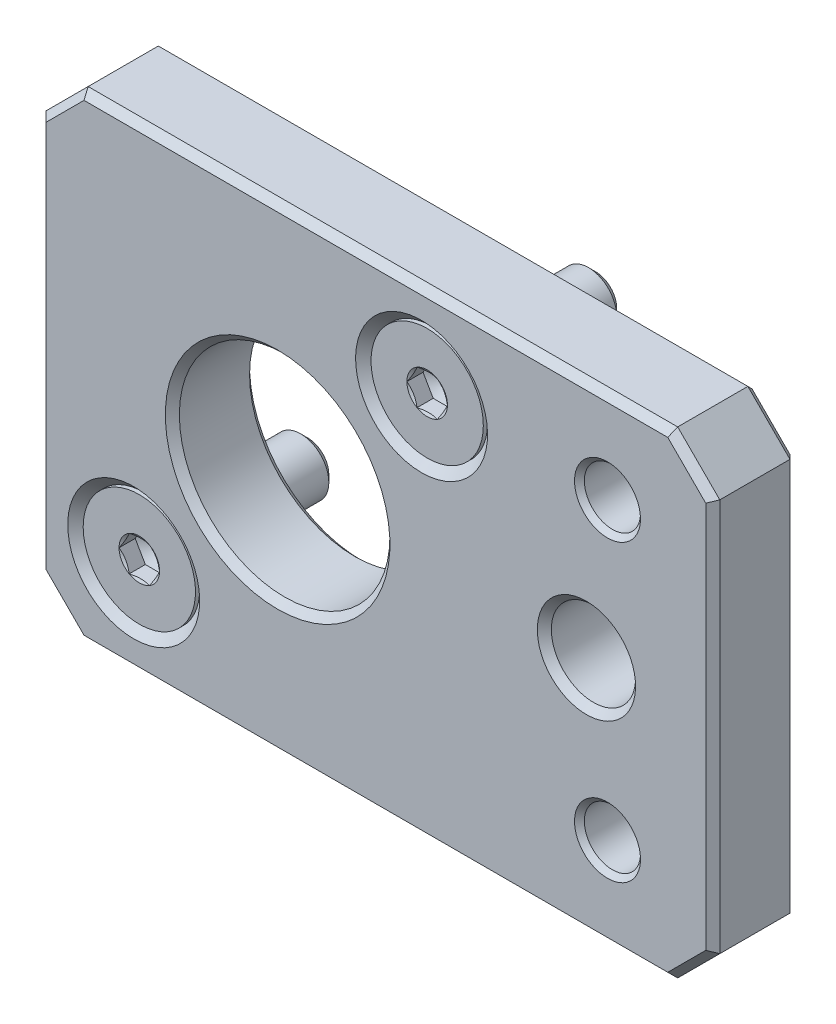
ISO-10303-21;
HEADER;
FILE_DESCRIPTION(('STEP AP214'),'2;1');
FILE_NAME('part.step','',(''),(''),'','','');
FILE_SCHEMA(('AUTOMOTIVE_DESIGN { 1 0 10303 214 1 1 1 1 }'));
ENDSEC;
DATA;
#1=APPLICATION_CONTEXT('core data for automotive mechanical design processes');
#2=APPLICATION_PROTOCOL_DEFINITION('international standard','automotive_design',2000,#1);
#3=PRODUCT_CONTEXT('',#1,'mechanical');
#4=PRODUCT('Part','Part','',(#3));
#5=PRODUCT_RELATED_PRODUCT_CATEGORY('part','',(#4));
#6=PRODUCT_DEFINITION_FORMATION('','',#4);
#7=PRODUCT_DEFINITION_CONTEXT('part definition',#1,'design');
#8=PRODUCT_DEFINITION('design','',#6,#7);
#9=PRODUCT_DEFINITION_SHAPE('','',#8);
#10=(LENGTH_UNIT() NAMED_UNIT(*) SI_UNIT(.MILLI.,.METRE.));
#11=(NAMED_UNIT(*) PLANE_ANGLE_UNIT() SI_UNIT($,.RADIAN.));
#12=(NAMED_UNIT(*) SI_UNIT($,.STERADIAN.) SOLID_ANGLE_UNIT());
#13=UNCERTAINTY_MEASURE_WITH_UNIT(LENGTH_MEASURE(1.E-05),#10,'distance_accuracy_value','');
#14=(GEOMETRIC_REPRESENTATION_CONTEXT(3) GLOBAL_UNCERTAINTY_ASSIGNED_CONTEXT((#13)) GLOBAL_UNIT_ASSIGNED_CONTEXT((#10,
#11,#12)) REPRESENTATION_CONTEXT('',''));
#15=CARTESIAN_POINT('',(0.,0.,0.));
#16=DIRECTION('',(0.,0.,1.));
#17=DIRECTION('',(1.,0.,0.));
#18=AXIS2_PLACEMENT_3D('',#15,#16,#17);
#19=CARTESIAN_POINT('',(-17.,17.,6.));
#20=DIRECTION('',(0.,-1.,0.));
#21=DIRECTION('',(0.,0.,-1.));
#22=AXIS2_PLACEMENT_3D('',#19,#20,#21);
#23=PLANE('',#22);
#24=DIRECTION('',(0.,0.,-1.));
#25=VECTOR('',#24,1.);
#26=CARTESIAN_POINT('',(28.,17.,6.));
#27=LINE('',#26,#25);
#28=CARTESIAN_POINT('',(28.,17.,5.5));
#29=VERTEX_POINT('',#28);
#30=CARTESIAN_POINT('',(28.,17.,0.5));
#31=VERTEX_POINT('',#30);
#32=EDGE_CURVE('E839',#29,#31,#27,.T.);
#33=ORIENTED_EDGE('',*,*,#32,.T.);
#34=DIRECTION('',(-1.,0.,0.));
#35=VECTOR('',#34,1.);
#36=CARTESIAN_POINT('',(-14.,17.,0.5));
#37=LINE('',#36,#35);
#38=CARTESIAN_POINT('',(-14.,17.,0.5));
#39=VERTEX_POINT('',#38);
#40=EDGE_CURVE('E904',#31,#39,#37,.T.);
#41=ORIENTED_EDGE('',*,*,#40,.T.);
#42=DIRECTION('',(0.,0.,1.));
#43=VECTOR('',#42,1.);
#44=CARTESIAN_POINT('',(-14.,17.,6.));
#45=LINE('',#44,#43);
#46=CARTESIAN_POINT('',(-14.,17.,5.5));
#47=VERTEX_POINT('',#46);
#48=EDGE_CURVE('E841',#39,#47,#45,.T.);
#49=ORIENTED_EDGE('',*,*,#48,.T.);
#50=DIRECTION('',(1.,0.,0.));
#51=VECTOR('',#50,1.);
#52=CARTESIAN_POINT('',(-17.,17.,5.5));
#53=LINE('',#52,#51);
#54=EDGE_CURVE('E902',#47,#29,#53,.T.);
#55=ORIENTED_EDGE('',*,*,#54,.T.);
#56=EDGE_LOOP('',(#33,#41,#49,#55));
#57=FACE_BOUND('',#56,.T.);
#58=ADVANCED_FACE('F14',(#57),#23,.F.);
#59=CARTESIAN_POINT('',(-17.,17.,6.));
#60=DIRECTION('',(1.,0.,0.));
#61=DIRECTION('',(0.,0.,1.));
#62=AXIS2_PLACEMENT_3D('',#59,#60,#61);
#63=PLANE('',#62);
#64=DIRECTION('',(0.,0.,-1.));
#65=VECTOR('',#64,1.);
#66=CARTESIAN_POINT('',(-17.,14.,6.));
#67=LINE('',#66,#65);
#68=CARTESIAN_POINT('',(-17.,14.,5.5));
#69=VERTEX_POINT('',#68);
#70=CARTESIAN_POINT('',(-17.,14.,0.5));
#71=VERTEX_POINT('',#70);
#72=EDGE_CURVE('E836',#69,#71,#67,.T.);
#73=ORIENTED_EDGE('',*,*,#72,.T.);
#74=DIRECTION('',(0.,-1.,0.));
#75=VECTOR('',#74,1.);
#76=CARTESIAN_POINT('',(-17.,-14.,0.5));
#77=LINE('',#76,#75);
#78=CARTESIAN_POINT('',(-17.,-14.,0.5));
#79=VERTEX_POINT('',#78);
#80=EDGE_CURVE('E895',#71,#79,#77,.T.);
#81=ORIENTED_EDGE('',*,*,#80,.T.);
#82=DIRECTION('',(0.,0.,1.));
#83=VECTOR('',#82,1.);
#84=CARTESIAN_POINT('',(-17.,-14.,6.));
#85=LINE('',#84,#83);
#86=CARTESIAN_POINT('',(-17.,-14.,5.5));
#87=VERTEX_POINT('',#86);
#88=EDGE_CURVE('E833',#79,#87,#85,.T.);
#89=ORIENTED_EDGE('',*,*,#88,.T.);
#90=DIRECTION('',(0.,1.,0.));
#91=VECTOR('',#90,1.);
#92=CARTESIAN_POINT('',(-17.,17.,5.5));
#93=LINE('',#92,#91);
#94=EDGE_CURVE('E893',#87,#69,#93,.T.);
#95=ORIENTED_EDGE('',*,*,#94,.T.);
#96=EDGE_LOOP('',(#73,#81,#89,#95));
#97=FACE_BOUND('',#96,.T.);
#98=ADVANCED_FACE('F224',(#97),#63,.F.);
#99=CARTESIAN_POINT('',(-17.,-17.,6.));
#100=DIRECTION('',(0.,1.,0.));
#101=DIRECTION('',(0.,0.,1.));
#102=AXIS2_PLACEMENT_3D('',#99,#100,#101);
#103=PLANE('',#102);
#104=DIRECTION('',(0.,0.,-1.));
#105=VECTOR('',#104,1.);
#106=CARTESIAN_POINT('',(-14.,-17.,6.));
#107=LINE('',#106,#105);
#108=CARTESIAN_POINT('',(-14.,-17.,5.5));
#109=VERTEX_POINT('',#108);
#110=CARTESIAN_POINT('',(-14.,-17.,0.5));
#111=VERTEX_POINT('',#110);
#112=EDGE_CURVE('E847',#109,#111,#107,.T.);
#113=ORIENTED_EDGE('',*,*,#112,.T.);
#114=DIRECTION('',(1.,0.,0.));
#115=VECTOR('',#114,1.);
#116=CARTESIAN_POINT('',(28.,-17.,0.5));
#117=LINE('',#116,#115);
#118=CARTESIAN_POINT('',(28.,-17.,0.5));
#119=VERTEX_POINT('',#118);
#120=EDGE_CURVE('E887',#111,#119,#117,.T.);
#121=ORIENTED_EDGE('',*,*,#120,.T.);
#122=DIRECTION('',(0.,0.,1.));
#123=VECTOR('',#122,1.);
#124=CARTESIAN_POINT('',(28.,-17.,6.));
#125=LINE('',#124,#123);
#126=CARTESIAN_POINT('',(28.,-17.,5.5));
#127=VERTEX_POINT('',#126);
#128=EDGE_CURVE('E844',#119,#127,#125,.T.);
#129=ORIENTED_EDGE('',*,*,#128,.T.);
#130=DIRECTION('',(-1.,0.,0.));
#131=VECTOR('',#130,1.);
#132=CARTESIAN_POINT('',(-17.,-17.,5.5));
#133=LINE('',#132,#131);
#134=EDGE_CURVE('E885',#127,#109,#133,.T.);
#135=ORIENTED_EDGE('',*,*,#134,.T.);
#136=EDGE_LOOP('',(#113,#121,#129,#135));
#137=FACE_BOUND('',#136,.T.);
#138=ADVANCED_FACE('F230',(#137),#103,.F.);
#139=CARTESIAN_POINT('',(31.,17.,6.));
#140=DIRECTION('',(-1.,0.,0.));
#141=DIRECTION('',(0.,0.,-1.));
#142=AXIS2_PLACEMENT_3D('',#139,#140,#141);
#143=PLANE('',#142);
#144=DIRECTION('',(0.,0.,-1.));
#145=VECTOR('',#144,1.);
#146=CARTESIAN_POINT('',(31.,-14.,6.));
#147=LINE('',#146,#145);
#148=CARTESIAN_POINT('',(31.,-14.,5.5));
#149=VERTEX_POINT('',#148);
#150=CARTESIAN_POINT('',(31.,-14.,0.5));
#151=VERTEX_POINT('',#150);
#152=EDGE_CURVE('E853',#149,#151,#147,.T.);
#153=ORIENTED_EDGE('',*,*,#152,.T.);
#154=DIRECTION('',(0.,1.,0.));
#155=VECTOR('',#154,1.);
#156=CARTESIAN_POINT('',(31.,14.,0.5));
#157=LINE('',#156,#155);
#158=CARTESIAN_POINT('',(31.,14.,0.5));
#159=VERTEX_POINT('',#158);
#160=EDGE_CURVE('E879',#151,#159,#157,.T.);
#161=ORIENTED_EDGE('',*,*,#160,.T.);
#162=DIRECTION('',(0.,0.,1.));
#163=VECTOR('',#162,1.);
#164=CARTESIAN_POINT('',(31.,14.,6.));
#165=LINE('',#164,#163);
#166=CARTESIAN_POINT('',(31.,14.,5.5));
#167=VERTEX_POINT('',#166);
#168=EDGE_CURVE('E850',#159,#167,#165,.T.);
#169=ORIENTED_EDGE('',*,*,#168,.T.);
#170=DIRECTION('',(0.,-1.,0.));
#171=VECTOR('',#170,1.);
#172=CARTESIAN_POINT('',(31.,17.,5.5));
#173=LINE('',#172,#171);
#174=EDGE_CURVE('E339',#167,#149,#173,.T.);
#175=ORIENTED_EDGE('',*,*,#174,.T.);
#176=EDGE_LOOP('',(#153,#161,#169,#175));
#177=FACE_BOUND('',#176,.T.);
#178=ADVANCED_FACE('F982',(#177),#143,.F.);
#179=CARTESIAN_POINT('',(31.,17.,6.));
#180=DIRECTION('',(0.,0.,-1.));
#181=DIRECTION('',(0.,1.,0.));
#182=AXIS2_PLACEMENT_3D('',#179,#180,#181);
#183=PLANE('',#182);
#184=DIRECTION('',(-1.,0.,0.));
#185=VECTOR('',#184,1.);
#186=CARTESIAN_POINT('',(31.,16.5,6.));
#187=LINE('',#186,#185);
#188=CARTESIAN_POINT('',(27.7928932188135,16.5,6.));
#189=VERTEX_POINT('',#188);
#190=CARTESIAN_POINT('',(-13.7928932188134,16.5,6.));
#191=VERTEX_POINT('',#190);
#192=EDGE_CURVE('E906',#189,#191,#187,.T.);
#193=ORIENTED_EDGE('',*,*,#192,.T.);
#194=DIRECTION('',(-0.707106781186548,-0.707106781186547,0.));
#195=VECTOR('',#194,1.);
#196=CARTESIAN_POINT('',(-16.6464466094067,13.6464466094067,6.));
#197=LINE('',#196,#195);
#198=CARTESIAN_POINT('',(-16.5,13.7928932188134,6.));
#199=VERTEX_POINT('',#198);
#200=EDGE_CURVE('E9',#191,#199,#197,.T.);
#201=ORIENTED_EDGE('',*,*,#200,.T.);
#202=DIRECTION('',(0.,-1.,0.));
#203=VECTOR('',#202,1.);
#204=CARTESIAN_POINT('',(-16.5,17.,6.));
#205=LINE('',#204,#203);
#206=CARTESIAN_POINT('',(-16.5,-13.7928932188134,6.));
#207=VERTEX_POINT('',#206);
#208=EDGE_CURVE('E23',#199,#207,#205,.T.);
#209=ORIENTED_EDGE('',*,*,#208,.T.);
#210=DIRECTION('',(0.707106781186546,-0.70710678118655,0.));
#211=VECTOR('',#210,1.);
#212=CARTESIAN_POINT('',(-13.6464466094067,-16.6464466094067,6.));
#213=LINE('',#212,#211);
#214=CARTESIAN_POINT('',(-13.7928932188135,-16.5,6.));
#215=VERTEX_POINT('',#214);
#216=EDGE_CURVE('E915',#207,#215,#213,.T.);
#217=ORIENTED_EDGE('',*,*,#216,.T.);
#218=DIRECTION('',(1.,0.,0.));
#219=VECTOR('',#218,1.);
#220=CARTESIAN_POINT('',(31.,-16.5,6.));
#221=LINE('',#220,#219);
#222=CARTESIAN_POINT('',(27.7928932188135,-16.5,6.));
#223=VERTEX_POINT('',#222);
#224=EDGE_CURVE('E913',#215,#223,#221,.T.);
#225=ORIENTED_EDGE('',*,*,#224,.T.);
#226=DIRECTION('',(0.70710678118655,0.707106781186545,0.));
#227=VECTOR('',#226,1.);
#228=CARTESIAN_POINT('',(30.6464466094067,-13.6464466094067,6.));
#229=LINE('',#228,#227);
#230=CARTESIAN_POINT('',(30.5,-13.7928932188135,6.));
#231=VERTEX_POINT('',#230);
#232=EDGE_CURVE('E911',#223,#231,#229,.T.);
#233=ORIENTED_EDGE('',*,*,#232,.T.);
#234=DIRECTION('',(0.,1.,0.));
#235=VECTOR('',#234,1.);
#236=CARTESIAN_POINT('',(30.5,17.,6.));
#237=LINE('',#236,#235);
#238=CARTESIAN_POINT('',(30.5,13.7928932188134,6.));
#239=VERTEX_POINT('',#238);
#240=EDGE_CURVE('E341',#231,#239,#237,.T.);
#241=ORIENTED_EDGE('',*,*,#240,.T.);
#242=DIRECTION('',(-0.707106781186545,0.70710678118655,0.));
#243=VECTOR('',#242,1.);
#244=CARTESIAN_POINT('',(27.6464466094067,16.6464466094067,6.));
#245=LINE('',#244,#243);
#246=EDGE_CURVE('E908',#239,#189,#245,.T.);
#247=ORIENTED_EDGE('',*,*,#246,.T.);
#248=EDGE_LOOP('',(#193,#201,#209,#217,#225,#233,#241,#247));
#249=FACE_BOUND('',#248,.T.);
#250=CARTESIAN_POINT('',(-10.253048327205,-10.2530483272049,6.));
#251=DIRECTION('',(0.,0.,1.));
#252=DIRECTION('',(0.,-1.,0.));
#253=AXIS2_PLACEMENT_3D('',#250,#251,#252);
#254=CIRCLE('',#253,4.7);
#255=CARTESIAN_POINT('',(-10.253048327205,-14.9530483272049,6.));
#256=VERTEX_POINT('',#255);
#257=EDGE_CURVE('E778',#256,#256,#254,.T.);
#258=ORIENTED_EDGE('',*,*,#257,.F.);
#259=EDGE_LOOP('',(#258));
#260=FACE_BOUND('',#259,.T.);
#261=CARTESIAN_POINT('',(0.,0.,6.));
#262=DIRECTION('',(0.,0.,-1.));
#263=DIRECTION('',(0.,1.,0.));
#264=AXIS2_PLACEMENT_3D('',#261,#262,#263);
#265=CIRCLE('',#264,8.);
#266=CARTESIAN_POINT('',(0.,8.,6.));
#267=VERTEX_POINT('',#266);
#268=EDGE_CURVE('E830',#267,#267,#265,.T.);
#269=ORIENTED_EDGE('',*,*,#268,.T.);
#270=EDGE_LOOP('',(#269));
#271=FACE_BOUND('',#270,.T.);
#272=CARTESIAN_POINT('',(22.,0.,6.));
#273=DIRECTION('',(0.,0.,-1.));
#274=DIRECTION('',(0.,1.,0.));
#275=AXIS2_PLACEMENT_3D('',#272,#273,#274);
#276=CIRCLE('',#275,3.5);
#277=CARTESIAN_POINT('',(22.,3.5,6.));
#278=VERTEX_POINT('',#277);
#279=EDGE_CURVE('E827',#278,#278,#276,.T.);
#280=ORIENTED_EDGE('',*,*,#279,.T.);
#281=EDGE_LOOP('',(#280));
#282=FACE_BOUND('',#281,.T.);
#283=CARTESIAN_POINT('',(10.2530483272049,10.253048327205,6.));
#284=DIRECTION('',(0.,0.,1.));
#285=DIRECTION('',(0.,-1.,0.));
#286=AXIS2_PLACEMENT_3D('',#283,#284,#285);
#287=CIRCLE('',#286,4.7);
#288=CARTESIAN_POINT('',(10.2530483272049,5.55304832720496,6.));
#289=VERTEX_POINT('',#288);
#290=EDGE_CURVE('E788',#289,#289,#287,.T.);
#291=ORIENTED_EDGE('',*,*,#290,.F.);
#292=EDGE_LOOP('',(#291));
#293=FACE_BOUND('',#292,.T.);
#294=CARTESIAN_POINT('',(23.5,10.5,6.));
#295=DIRECTION('',(0.,0.,1.));
#296=DIRECTION('',(0.,-1.,0.));
#297=AXIS2_PLACEMENT_3D('',#294,#295,#296);
#298=CIRCLE('',#297,2.35);
#299=CARTESIAN_POINT('',(23.5,8.15,6.));
#300=VERTEX_POINT('',#299);
#301=EDGE_CURVE('E797',#300,#300,#298,.T.);
#302=ORIENTED_EDGE('',*,*,#301,.F.);
#303=EDGE_LOOP('',(#302));
#304=FACE_BOUND('',#303,.T.);
#305=CARTESIAN_POINT('',(23.5,-10.5,6.));
#306=DIRECTION('',(0.,0.,1.));
#307=DIRECTION('',(0.,-1.,0.));
#308=AXIS2_PLACEMENT_3D('',#305,#306,#307);
#309=CIRCLE('',#308,2.35);
#310=CARTESIAN_POINT('',(23.5,-12.85,6.));
#311=VERTEX_POINT('',#310);
#312=EDGE_CURVE('E803',#311,#311,#309,.T.);
#313=ORIENTED_EDGE('',*,*,#312,.F.);
#314=EDGE_LOOP('',(#313));
#315=FACE_BOUND('',#314,.T.);
#316=ADVANCED_FACE('F951',(#249,#260,#271,#282,#293,#304,#315),#183,.F.);
#317=CARTESIAN_POINT('',(31.,17.,0.));
#318=DIRECTION('',(0.,0.,-1.));
#319=DIRECTION('',(0.,1.,0.));
#320=AXIS2_PLACEMENT_3D('',#317,#318,#319);
#321=PLANE('',#320);
#322=DIRECTION('',(1.,0.,0.));
#323=VECTOR('',#322,1.);
#324=CARTESIAN_POINT('',(28.,16.5,0.));
#325=LINE('',#324,#323);
#326=CARTESIAN_POINT('',(-13.7928932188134,16.5,0.));
#327=VERTEX_POINT('',#326);
#328=CARTESIAN_POINT('',(27.7928932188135,16.5,0.));
#329=VERTEX_POINT('',#328);
#330=EDGE_CURVE('E856',#327,#329,#325,.T.);
#331=ORIENTED_EDGE('',*,*,#330,.T.);
#332=DIRECTION('',(0.707106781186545,-0.70710678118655,0.));
#333=VECTOR('',#332,1.);
#334=CARTESIAN_POINT('',(29.1464466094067,15.1464466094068,0.));
#335=LINE('',#334,#333);
#336=CARTESIAN_POINT('',(30.5,13.7928932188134,0.));
#337=VERTEX_POINT('',#336);
#338=EDGE_CURVE('E870',#329,#337,#335,.T.);
#339=ORIENTED_EDGE('',*,*,#338,.T.);
#340=DIRECTION('',(0.,-1.,0.));
#341=VECTOR('',#340,1.);
#342=CARTESIAN_POINT('',(30.5,-14.,0.));
#343=LINE('',#342,#341);
#344=CARTESIAN_POINT('',(30.5,-13.7928932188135,0.));
#345=VERTEX_POINT('',#344);
#346=EDGE_CURVE('E868',#337,#345,#343,.T.);
#347=ORIENTED_EDGE('',*,*,#346,.T.);
#348=DIRECTION('',(-0.70710678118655,-0.707106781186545,0.));
#349=VECTOR('',#348,1.);
#350=CARTESIAN_POINT('',(46.1464466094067,1.85355339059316,0.));
#351=LINE('',#350,#349);
#352=CARTESIAN_POINT('',(27.7928932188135,-16.5,0.));
#353=VERTEX_POINT('',#352);
#354=EDGE_CURVE('E866',#345,#353,#351,.T.);
#355=ORIENTED_EDGE('',*,*,#354,.T.);
#356=DIRECTION('',(-1.,0.,0.));
#357=VECTOR('',#356,1.);
#358=CARTESIAN_POINT('',(-14.,-16.5,0.));
#359=LINE('',#358,#357);
#360=CARTESIAN_POINT('',(-13.7928932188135,-16.5,0.));
#361=VERTEX_POINT('',#360);
#362=EDGE_CURVE('E864',#353,#361,#359,.T.);
#363=ORIENTED_EDGE('',*,*,#362,.T.);
#364=DIRECTION('',(-0.707106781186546,0.70710678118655,0.));
#365=VECTOR('',#364,1.);
#366=CARTESIAN_POINT('',(-8.14644660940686,-22.1464466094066,0.));
#367=LINE('',#366,#365);
#368=CARTESIAN_POINT('',(-16.5,-13.7928932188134,0.));
#369=VERTEX_POINT('',#368);
#370=EDGE_CURVE('E862',#361,#369,#367,.T.);
#371=ORIENTED_EDGE('',*,*,#370,.T.);
#372=DIRECTION('',(0.,1.,0.));
#373=VECTOR('',#372,1.);
#374=CARTESIAN_POINT('',(-16.5,14.,0.));
#375=LINE('',#374,#373);
#376=CARTESIAN_POINT('',(-16.5,13.7928932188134,0.));
#377=VERTEX_POINT('',#376);
#378=EDGE_CURVE('E860',#369,#377,#375,.T.);
#379=ORIENTED_EDGE('',*,*,#378,.T.);
#380=DIRECTION('',(0.707106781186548,0.707106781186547,0.));
#381=VECTOR('',#380,1.);
#382=CARTESIAN_POINT('',(8.85355339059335,39.1464466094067,0.));
#383=LINE('',#382,#381);
#384=EDGE_CURVE('E858',#377,#327,#383,.T.);
#385=ORIENTED_EDGE('',*,*,#384,.T.);
#386=EDGE_LOOP('',(#331,#339,#347,#355,#363,#371,#379,#385));
#387=FACE_BOUND('',#386,.T.);
#388=CARTESIAN_POINT('',(-10.253048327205,-10.2530483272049,0.));
#389=DIRECTION('',(0.,0.,1.));
#390=DIRECTION('',(0.,-1.,0.));
#391=AXIS2_PLACEMENT_3D('',#388,#389,#390);
#392=CIRCLE('',#391,2.75);
#393=CARTESIAN_POINT('',(-10.253048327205,-13.0030483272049,0.));
#394=VERTEX_POINT('',#393);
#395=EDGE_CURVE('E785',#394,#394,#392,.T.);
#396=ORIENTED_EDGE('',*,*,#395,.T.);
#397=EDGE_LOOP('',(#396));
#398=FACE_BOUND('',#397,.T.);
#399=CARTESIAN_POINT('',(0.,0.,0.));
#400=DIRECTION('',(0.,0.,-1.));
#401=DIRECTION('',(0.,1.,0.));
#402=AXIS2_PLACEMENT_3D('',#399,#400,#401);
#403=CIRCLE('',#402,8.);
#404=CARTESIAN_POINT('',(0.,8.,0.));
#405=VERTEX_POINT('',#404);
#406=EDGE_CURVE('E812',#405,#405,#403,.F.);
#407=ORIENTED_EDGE('',*,*,#406,.T.);
#408=EDGE_LOOP('',(#407));
#409=FACE_BOUND('',#408,.T.);
#410=CARTESIAN_POINT('',(22.,0.,0.));
#411=DIRECTION('',(0.,0.,-1.));
#412=DIRECTION('',(0.,1.,0.));
#413=AXIS2_PLACEMENT_3D('',#410,#411,#412);
#414=CIRCLE('',#413,3.5);
#415=CARTESIAN_POINT('',(22.,3.5,0.));
#416=VERTEX_POINT('',#415);
#417=EDGE_CURVE('E809',#416,#416,#414,.F.);
#418=ORIENTED_EDGE('',*,*,#417,.T.);
#419=EDGE_LOOP('',(#418));
#420=FACE_BOUND('',#419,.T.);
#421=CARTESIAN_POINT('',(10.2530483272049,10.253048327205,0.));
#422=DIRECTION('',(0.,0.,1.));
#423=DIRECTION('',(0.,-1.,0.));
#424=AXIS2_PLACEMENT_3D('',#421,#422,#423);
#425=CIRCLE('',#424,2.75);
#426=CARTESIAN_POINT('',(10.2530483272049,7.50304832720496,0.));
#427=VERTEX_POINT('',#426);
#428=EDGE_CURVE('E794',#427,#427,#425,.T.);
#429=ORIENTED_EDGE('',*,*,#428,.T.);
#430=EDGE_LOOP('',(#429));
#431=FACE_BOUND('',#430,.T.);
#432=CARTESIAN_POINT('',(23.5,10.5,0.));
#433=DIRECTION('',(0.,0.,1.));
#434=DIRECTION('',(0.,-1.,0.));
#435=AXIS2_PLACEMENT_3D('',#432,#433,#434);
#436=CIRCLE('',#435,2.35);
#437=CARTESIAN_POINT('',(23.5,8.15,0.));
#438=VERTEX_POINT('',#437);
#439=EDGE_CURVE('E800',#438,#438,#436,.T.);
#440=ORIENTED_EDGE('',*,*,#439,.T.);
#441=EDGE_LOOP('',(#440));
#442=FACE_BOUND('',#441,.T.);
#443=CARTESIAN_POINT('',(23.5,-10.5,0.));
#444=DIRECTION('',(0.,0.,1.));
#445=DIRECTION('',(0.,-1.,0.));
#446=AXIS2_PLACEMENT_3D('',#443,#444,#445);
#447=CIRCLE('',#446,2.35);
#448=CARTESIAN_POINT('',(23.5,-12.85,0.));
#449=VERTEX_POINT('',#448);
#450=EDGE_CURVE('E806',#449,#449,#447,.T.);
#451=ORIENTED_EDGE('',*,*,#450,.T.);
#452=EDGE_LOOP('',(#451));
#453=FACE_BOUND('',#452,.T.);
#454=ADVANCED_FACE('F973',(#387,#398,#409,#420,#431,#442,#453),#321,.T.);
#455=CARTESIAN_POINT('',(0.,0.,0.));
#456=DIRECTION('',(0.,0.,1.));
#457=DIRECTION('',(0.,-1.,0.));
#458=AXIS2_PLACEMENT_3D('',#455,#456,#457);
#459=CYLINDRICAL_SURFACE('',#458,7.5);
#460=CARTESIAN_POINT('',(0.,0.,0.5));
#461=DIRECTION('',(0.,0.,-1.));
#462=DIRECTION('',(0.,1.,0.));
#463=AXIS2_PLACEMENT_3D('',#460,#461,#462);
#464=CIRCLE('',#463,7.5);
#465=CARTESIAN_POINT('',(0.,7.5,0.5));
#466=VERTEX_POINT('',#465);
#467=EDGE_CURVE('E818',#466,#466,#464,.T.);
#468=ORIENTED_EDGE('',*,*,#467,.T.);
#469=EDGE_LOOP('',(#468));
#470=FACE_BOUND('',#469,.T.);
#471=CARTESIAN_POINT('',(0.,0.,5.5));
#472=DIRECTION('',(0.,0.,-1.));
#473=DIRECTION('',(0.,1.,0.));
#474=AXIS2_PLACEMENT_3D('',#471,#472,#473);
#475=CIRCLE('',#474,7.5);
#476=CARTESIAN_POINT('',(0.,7.5,5.5));
#477=VERTEX_POINT('',#476);
#478=EDGE_CURVE('E815',#477,#477,#475,.F.);
#479=ORIENTED_EDGE('',*,*,#478,.T.);
#480=EDGE_LOOP('',(#479));
#481=FACE_BOUND('',#480,.T.);
#482=ADVANCED_FACE('F1009',(#470,#481),#459,.F.);
#483=CARTESIAN_POINT('',(22.,0.,0.));
#484=DIRECTION('',(0.,0.,1.));
#485=DIRECTION('',(0.,-1.,0.));
#486=AXIS2_PLACEMENT_3D('',#483,#484,#485);
#487=CYLINDRICAL_SURFACE('',#486,3.);
#488=CARTESIAN_POINT('',(22.,0.,0.5));
#489=DIRECTION('',(0.,0.,-1.));
#490=DIRECTION('',(0.,1.,0.));
#491=AXIS2_PLACEMENT_3D('',#488,#489,#490);
#492=CIRCLE('',#491,3.);
#493=CARTESIAN_POINT('',(22.,3.,0.5));
#494=VERTEX_POINT('',#493);
#495=EDGE_CURVE('E824',#494,#494,#492,.T.);
#496=ORIENTED_EDGE('',*,*,#495,.T.);
#497=EDGE_LOOP('',(#496));
#498=FACE_BOUND('',#497,.T.);
#499=CARTESIAN_POINT('',(22.,0.,5.5));
#500=DIRECTION('',(0.,0.,-1.));
#501=DIRECTION('',(0.,1.,0.));
#502=AXIS2_PLACEMENT_3D('',#499,#500,#501);
#503=CIRCLE('',#502,3.);
#504=CARTESIAN_POINT('',(22.,3.,5.5));
#505=VERTEX_POINT('',#504);
#506=EDGE_CURVE('E821',#505,#505,#503,.F.);
#507=ORIENTED_EDGE('',*,*,#506,.T.);
#508=EDGE_LOOP('',(#507));
#509=FACE_BOUND('',#508,.T.);
#510=ADVANCED_FACE('F1013',(#498,#509),#487,.F.);
#511=CARTESIAN_POINT('',(23.5,-10.5,0.7));
#512=DIRECTION('',(0.,0.,-1.));
#513=DIRECTION('',(0.,1.,0.));
#514=AXIS2_PLACEMENT_3D('',#511,#512,#513);
#515=CONICAL_SURFACE('',#514,1.65,0.785398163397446);
#516=CARTESIAN_POINT('',(23.5,-10.5,0.35));
#517=DIRECTION('',(0.,0.,-1.));
#518=DIRECTION('',(0.,1.,0.));
#519=AXIS2_PLACEMENT_3D('',#516,#517,#518);
#520=CIRCLE('',#519,2.);
#521=CARTESIAN_POINT('',(23.5,-8.5,0.35));
#522=VERTEX_POINT('',#521);
#523=EDGE_CURVE('E355',#522,#522,#520,.F.);
#524=ORIENTED_EDGE('',*,*,#523,.T.);
#525=EDGE_LOOP('',(#524));
#526=FACE_BOUND('',#525,.T.);
#527=ORIENTED_EDGE('',*,*,#450,.F.);
#528=EDGE_LOOP('',(#527));
#529=FACE_BOUND('',#528,.T.);
#530=ADVANCED_FACE('F1017',(#526,#529),#515,.F.);
#531=CARTESIAN_POINT('',(23.5,-10.5,6.));
#532=DIRECTION('',(0.,0.,1.));
#533=DIRECTION('',(0.,-1.,0.));
#534=AXIS2_PLACEMENT_3D('',#531,#532,#533);
#535=CONICAL_SURFACE('',#534,2.35,0.785398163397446);
#536=CARTESIAN_POINT('',(23.5,-10.5,5.65));
#537=DIRECTION('',(0.,0.,1.));
#538=DIRECTION('',(0.,-1.,0.));
#539=AXIS2_PLACEMENT_3D('',#536,#537,#538);
#540=CIRCLE('',#539,2.);
#541=CARTESIAN_POINT('',(23.5,-12.5,5.65));
#542=VERTEX_POINT('',#541);
#543=EDGE_CURVE('E353',#542,#542,#540,.F.);
#544=ORIENTED_EDGE('',*,*,#543,.T.);
#545=EDGE_LOOP('',(#544));
#546=FACE_BOUND('',#545,.T.);
#547=ORIENTED_EDGE('',*,*,#312,.T.);
#548=EDGE_LOOP('',(#547));
#549=FACE_BOUND('',#548,.T.);
#550=ADVANCED_FACE('F1021',(#546,#549),#535,.F.);
#551=CARTESIAN_POINT('',(23.5,10.5,0.7));
#552=DIRECTION('',(0.,0.,-1.));
#553=DIRECTION('',(0.,1.,0.));
#554=AXIS2_PLACEMENT_3D('',#551,#552,#553);
#555=CONICAL_SURFACE('',#554,1.65,0.785398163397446);
#556=CARTESIAN_POINT('',(23.5,10.5,0.35));
#557=DIRECTION('',(0.,0.,-1.));
#558=DIRECTION('',(0.,1.,0.));
#559=AXIS2_PLACEMENT_3D('',#556,#557,#558);
#560=CIRCLE('',#559,2.);
#561=CARTESIAN_POINT('',(23.5,12.5,0.35));
#562=VERTEX_POINT('',#561);
#563=EDGE_CURVE('E356',#562,#562,#560,.F.);
#564=ORIENTED_EDGE('',*,*,#563,.T.);
#565=EDGE_LOOP('',(#564));
#566=FACE_BOUND('',#565,.T.);
#567=ORIENTED_EDGE('',*,*,#439,.F.);
#568=EDGE_LOOP('',(#567));
#569=FACE_BOUND('',#568,.T.);
#570=ADVANCED_FACE('F1025',(#566,#569),#555,.F.);
#571=CARTESIAN_POINT('',(23.5,10.5,6.));
#572=DIRECTION('',(0.,0.,1.));
#573=DIRECTION('',(0.,-1.,0.));
#574=AXIS2_PLACEMENT_3D('',#571,#572,#573);
#575=CONICAL_SURFACE('',#574,2.35,0.785398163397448);
#576=CARTESIAN_POINT('',(23.5,10.5,5.65));
#577=DIRECTION('',(0.,0.,1.));
#578=DIRECTION('',(0.,-1.,0.));
#579=AXIS2_PLACEMENT_3D('',#576,#577,#578);
#580=CIRCLE('',#579,2.);
#581=CARTESIAN_POINT('',(23.5,8.5,5.65));
#582=VERTEX_POINT('',#581);
#583=EDGE_CURVE('E18',#582,#582,#580,.F.);
#584=ORIENTED_EDGE('',*,*,#583,.T.);
#585=EDGE_LOOP('',(#584));
#586=FACE_BOUND('',#585,.T.);
#587=ORIENTED_EDGE('',*,*,#301,.T.);
#588=EDGE_LOOP('',(#587));
#589=FACE_BOUND('',#588,.T.);
#590=ADVANCED_FACE('F1028',(#586,#589),#575,.F.);
#591=CARTESIAN_POINT('',(10.2530483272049,10.253048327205,0.5));
#592=DIRECTION('',(0.,0.,-1.));
#593=DIRECTION('',(0.,1.,0.));
#594=AXIS2_PLACEMENT_3D('',#591,#592,#593);
#595=CONICAL_SURFACE('',#594,2.25,0.785398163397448);
#596=ORIENTED_EDGE('',*,*,#428,.F.);
#597=EDGE_LOOP('',(#596));
#598=FACE_BOUND('',#597,.T.);
#599=CARTESIAN_POINT('',(10.2530483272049,10.253048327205,0.5));
#600=DIRECTION('',(0.,0.,1.));
#601=DIRECTION('',(0.,-1.,0.));
#602=AXIS2_PLACEMENT_3D('',#599,#600,#601);
#603=CIRCLE('',#602,2.25);
#604=CARTESIAN_POINT('',(10.2530483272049,8.00304832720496,0.5));
#605=VERTEX_POINT('',#604);
#606=EDGE_CURVE('E791',#605,#605,#603,.T.);
#607=ORIENTED_EDGE('',*,*,#606,.T.);
#608=EDGE_LOOP('',(#607));
#609=FACE_BOUND('',#608,.T.);
#610=ADVANCED_FACE('F1031',(#598,#609),#595,.F.);
#611=CARTESIAN_POINT('',(10.2530483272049,10.253048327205,6.));
#612=DIRECTION('',(0.,0.,1.));
#613=DIRECTION('',(0.,-1.,0.));
#614=AXIS2_PLACEMENT_3D('',#611,#612,#613);
#615=CYLINDRICAL_SURFACE('',#614,2.25);
#616=ORIENTED_EDGE('',*,*,#606,.F.);
#617=EDGE_LOOP('',(#616));
#618=FACE_BOUND('',#617,.T.);
#619=CARTESIAN_POINT('',(10.2530483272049,10.253048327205,3.55));
#620=DIRECTION('',(0.,0.,1.));
#621=DIRECTION('',(0.,-1.,0.));
#622=AXIS2_PLACEMENT_3D('',#619,#620,#621);
#623=CIRCLE('',#622,2.25);
#624=CARTESIAN_POINT('',(10.2530483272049,8.00304832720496,3.55));
#625=VERTEX_POINT('',#624);
#626=EDGE_CURVE('E775',#625,#625,#623,.T.);
#627=ORIENTED_EDGE('',*,*,#626,.T.);
#628=EDGE_LOOP('',(#627));
#629=FACE_BOUND('',#628,.T.);
#630=ADVANCED_FACE('F1035',(#618,#629),#615,.F.);
#631=CARTESIAN_POINT('',(10.2530483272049,10.253048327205,6.));
#632=DIRECTION('',(0.,0.,1.));
#633=DIRECTION('',(0.,-1.,0.));
#634=AXIS2_PLACEMENT_3D('',#631,#632,#633);
#635=CONICAL_SURFACE('',#634,4.7,0.785398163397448);
#636=CARTESIAN_POINT('',(10.2530483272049,10.253048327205,5.29999999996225));
#637=DIRECTION('',(0.,0.,1.));
#638=DIRECTION('',(1.,0.,0.));
#639=AXIS2_PLACEMENT_3D('',#636,#637,#638);
#640=CIRCLE('',#639,3.99999999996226);
#641=CARTESIAN_POINT('',(14.2530483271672,10.2530483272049,5.29999999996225));
#642=VERTEX_POINT('',#641);
#643=EDGE_CURVE('E602',#642,#642,#640,.F.);
#644=ORIENTED_EDGE('',*,*,#643,.T.);
#645=EDGE_LOOP('',(#644));
#646=FACE_BOUND('',#645,.T.);
#647=ORIENTED_EDGE('',*,*,#290,.T.);
#648=EDGE_LOOP('',(#647));
#649=FACE_BOUND('',#648,.T.);
#650=ADVANCED_FACE('F240',(#646,#649),#635,.F.);
#651=CARTESIAN_POINT('',(0.,0.,0.));
#652=DIRECTION('',(0.,0.,-1.));
#653=DIRECTION('',(0.,1.,0.));
#654=AXIS2_PLACEMENT_3D('',#651,#652,#653);
#655=CONICAL_SURFACE('',#654,8.,0.785398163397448);
#656=ORIENTED_EDGE('',*,*,#467,.F.);
#657=EDGE_LOOP('',(#656));
#658=FACE_BOUND('',#657,.T.);
#659=ORIENTED_EDGE('',*,*,#406,.F.);
#660=EDGE_LOOP('',(#659));
#661=FACE_BOUND('',#660,.T.);
#662=ADVANCED_FACE('F236',(#658,#661),#655,.F.);
#663=CARTESIAN_POINT('',(22.,0.,0.));
#664=DIRECTION('',(0.,0.,-1.));
#665=DIRECTION('',(0.,1.,0.));
#666=AXIS2_PLACEMENT_3D('',#663,#664,#665);
#667=CONICAL_SURFACE('',#666,3.5,0.785398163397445);
#668=ORIENTED_EDGE('',*,*,#495,.F.);
#669=EDGE_LOOP('',(#668));
#670=FACE_BOUND('',#669,.T.);
#671=ORIENTED_EDGE('',*,*,#417,.F.);
#672=EDGE_LOOP('',(#671));
#673=FACE_BOUND('',#672,.T.);
#674=ADVANCED_FACE('F239',(#670,#673),#667,.F.);
#675=CARTESIAN_POINT('',(0.,0.,5.5));
#676=DIRECTION('',(0.,0.,1.));
#677=DIRECTION('',(0.,-1.,0.));
#678=AXIS2_PLACEMENT_3D('',#675,#676,#677);
#679=CONICAL_SURFACE('',#678,7.5,0.785398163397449);
#680=ORIENTED_EDGE('',*,*,#268,.F.);
#681=EDGE_LOOP('',(#680));
#682=FACE_BOUND('',#681,.T.);
#683=ORIENTED_EDGE('',*,*,#478,.F.);
#684=EDGE_LOOP('',(#683));
#685=FACE_BOUND('',#684,.T.);
#686=ADVANCED_FACE('F244',(#682,#685),#679,.F.);
#687=CARTESIAN_POINT('',(22.,0.,5.5));
#688=DIRECTION('',(0.,0.,1.));
#689=DIRECTION('',(0.,-1.,0.));
#690=AXIS2_PLACEMENT_3D('',#687,#688,#689);
#691=CONICAL_SURFACE('',#690,3.,0.78539816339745);
#692=ORIENTED_EDGE('',*,*,#279,.F.);
#693=EDGE_LOOP('',(#692));
#694=FACE_BOUND('',#693,.T.);
#695=ORIENTED_EDGE('',*,*,#506,.F.);
#696=EDGE_LOOP('',(#695));
#697=FACE_BOUND('',#696,.T.);
#698=ADVANCED_FACE('F248',(#694,#697),#691,.F.);
#699=CARTESIAN_POINT('',(-10.253048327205,-10.2530483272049,0.5));
#700=DIRECTION('',(0.,0.,-1.));
#701=DIRECTION('',(0.,1.,0.));
#702=AXIS2_PLACEMENT_3D('',#699,#700,#701);
#703=CONICAL_SURFACE('',#702,2.25,0.785398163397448);
#704=ORIENTED_EDGE('',*,*,#395,.F.);
#705=EDGE_LOOP('',(#704));
#706=FACE_BOUND('',#705,.T.);
#707=CARTESIAN_POINT('',(-10.253048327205,-10.2530483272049,0.5));
#708=DIRECTION('',(0.,0.,1.));
#709=DIRECTION('',(0.,-1.,0.));
#710=AXIS2_PLACEMENT_3D('',#707,#708,#709);
#711=CIRCLE('',#710,2.25);
#712=CARTESIAN_POINT('',(-10.253048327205,-12.5030483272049,0.5));
#713=VERTEX_POINT('',#712);
#714=EDGE_CURVE('E781',#713,#713,#711,.T.);
#715=ORIENTED_EDGE('',*,*,#714,.T.);
#716=EDGE_LOOP('',(#715));
#717=FACE_BOUND('',#716,.T.);
#718=ADVANCED_FACE('F252',(#706,#717),#703,.F.);
#719=CARTESIAN_POINT('',(-10.253048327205,-10.2530483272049,6.));
#720=DIRECTION('',(0.,0.,1.));
#721=DIRECTION('',(0.,-1.,0.));
#722=AXIS2_PLACEMENT_3D('',#719,#720,#721);
#723=CYLINDRICAL_SURFACE('',#722,2.25);
#724=ORIENTED_EDGE('',*,*,#714,.F.);
#725=EDGE_LOOP('',(#724));
#726=FACE_BOUND('',#725,.T.);
#727=CARTESIAN_POINT('',(-10.253048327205,-10.2530483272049,3.55));
#728=DIRECTION('',(0.,0.,1.));
#729=DIRECTION('',(0.,-1.,0.));
#730=AXIS2_PLACEMENT_3D('',#727,#728,#729);
#731=CIRCLE('',#730,2.25);
#732=CARTESIAN_POINT('',(-10.253048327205,-12.5030483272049,3.55));
#733=VERTEX_POINT('',#732);
#734=EDGE_CURVE('E569',#733,#733,#731,.T.);
#735=ORIENTED_EDGE('',*,*,#734,.T.);
#736=EDGE_LOOP('',(#735));
#737=FACE_BOUND('',#736,.T.);
#738=ADVANCED_FACE('F1045',(#726,#737),#723,.F.);
#739=CARTESIAN_POINT('',(-10.253048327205,-10.2530483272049,6.));
#740=DIRECTION('',(0.,0.,1.));
#741=DIRECTION('',(0.,-1.,0.));
#742=AXIS2_PLACEMENT_3D('',#739,#740,#741);
#743=CONICAL_SURFACE('',#742,4.7,0.785398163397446);
#744=CARTESIAN_POINT('',(-10.253048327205,-10.2530483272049,5.29999999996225));
#745=DIRECTION('',(0.,0.,1.));
#746=DIRECTION('',(-1.,0.,0.));
#747=AXIS2_PLACEMENT_3D('',#744,#745,#746);
#748=CIRCLE('',#747,3.99999999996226);
#749=CARTESIAN_POINT('',(-14.2530483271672,-10.2530483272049,5.29999999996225));
#750=VERTEX_POINT('',#749);
#751=EDGE_CURVE('E397',#750,#750,#748,.F.);
#752=ORIENTED_EDGE('',*,*,#751,.T.);
#753=EDGE_LOOP('',(#752));
#754=FACE_BOUND('',#753,.T.);
#755=ORIENTED_EDGE('',*,*,#257,.T.);
#756=EDGE_LOOP('',(#755));
#757=FACE_BOUND('',#756,.T.);
#758=ADVANCED_FACE('F258',(#754,#757),#743,.F.);
#759=CARTESIAN_POINT('',(-17.,14.,6.));
#760=DIRECTION('',(0.707106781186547,-0.707106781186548,0.));
#761=DIRECTION('',(0.707106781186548,0.707106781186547,0.));
#762=AXIS2_PLACEMENT_3D('',#759,#760,#761);
#763=PLANE('',#762);
#764=ORIENTED_EDGE('',*,*,#48,.F.);
#765=DIRECTION('',(0.707106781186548,0.707106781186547,0.));
#766=VECTOR('',#765,1.);
#767=CARTESIAN_POINT('',(-17.,14.,0.5));
#768=LINE('',#767,#766);
#769=EDGE_CURVE('E900',#39,#71,#768,.F.);
#770=ORIENTED_EDGE('',*,*,#769,.T.);
#771=ORIENTED_EDGE('',*,*,#72,.F.);
#772=DIRECTION('',(-0.707106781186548,-0.707106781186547,0.));
#773=VECTOR('',#772,1.);
#774=CARTESIAN_POINT('',(-14.,17.,5.5));
#775=LINE('',#774,#773);
#776=EDGE_CURVE('E897',#69,#47,#775,.F.);
#777=ORIENTED_EDGE('',*,*,#776,.T.);
#778=EDGE_LOOP('',(#764,#770,#771,#777));
#779=FACE_BOUND('',#778,.T.);
#780=ADVANCED_FACE('F254',(#779),#763,.F.);
#781=CARTESIAN_POINT('',(-14.,-17.,6.));
#782=DIRECTION('',(0.70710678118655,0.707106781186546,0.));
#783=DIRECTION('',(-0.707106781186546,0.70710678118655,0.));
#784=AXIS2_PLACEMENT_3D('',#781,#782,#783);
#785=PLANE('',#784);
#786=ORIENTED_EDGE('',*,*,#88,.F.);
#787=DIRECTION('',(-0.707106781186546,0.70710678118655,0.));
#788=VECTOR('',#787,1.);
#789=CARTESIAN_POINT('',(-14.,-17.,0.5));
#790=LINE('',#789,#788);
#791=EDGE_CURVE('E891',#79,#111,#790,.F.);
#792=ORIENTED_EDGE('',*,*,#791,.T.);
#793=ORIENTED_EDGE('',*,*,#112,.F.);
#794=DIRECTION('',(0.707106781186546,-0.70710678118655,0.));
#795=VECTOR('',#794,1.);
#796=CARTESIAN_POINT('',(-17.,-14.,5.5));
#797=LINE('',#796,#795);
#798=EDGE_CURVE('E889',#109,#87,#797,.F.);
#799=ORIENTED_EDGE('',*,*,#798,.T.);
#800=EDGE_LOOP('',(#786,#792,#793,#799));
#801=FACE_BOUND('',#800,.T.);
#802=ADVANCED_FACE('F257',(#801),#785,.F.);
#803=CARTESIAN_POINT('',(31.,-14.,6.));
#804=DIRECTION('',(-0.707106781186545,0.70710678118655,0.));
#805=DIRECTION('',(-0.70710678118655,-0.707106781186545,0.));
#806=AXIS2_PLACEMENT_3D('',#803,#804,#805);
#807=PLANE('',#806);
#808=ORIENTED_EDGE('',*,*,#128,.F.);
#809=DIRECTION('',(-0.70710678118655,-0.707106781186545,0.));
#810=VECTOR('',#809,1.);
#811=CARTESIAN_POINT('',(31.,-14.,0.5));
#812=LINE('',#811,#810);
#813=EDGE_CURVE('E883',#119,#151,#812,.F.);
#814=ORIENTED_EDGE('',*,*,#813,.T.);
#815=ORIENTED_EDGE('',*,*,#152,.F.);
#816=DIRECTION('',(0.70710678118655,0.707106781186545,0.));
#817=VECTOR('',#816,1.);
#818=CARTESIAN_POINT('',(28.,-17.,5.5));
#819=LINE('',#818,#817);
#820=EDGE_CURVE('E881',#149,#127,#819,.F.);
#821=ORIENTED_EDGE('',*,*,#820,.T.);
#822=EDGE_LOOP('',(#808,#814,#815,#821));
#823=FACE_BOUND('',#822,.T.);
#824=ADVANCED_FACE('F262',(#823),#807,.F.);
#825=CARTESIAN_POINT('',(28.,17.,6.));
#826=DIRECTION('',(-0.70710678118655,-0.707106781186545,0.));
#827=DIRECTION('',(0.707106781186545,-0.70710678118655,0.));
#828=AXIS2_PLACEMENT_3D('',#825,#826,#827);
#829=PLANE('',#828);
#830=ORIENTED_EDGE('',*,*,#168,.F.);
#831=DIRECTION('',(0.707106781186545,-0.70710678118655,0.));
#832=VECTOR('',#831,1.);
#833=CARTESIAN_POINT('',(28.,17.,0.5));
#834=LINE('',#833,#832);
#835=EDGE_CURVE('E875',#159,#31,#834,.F.);
#836=ORIENTED_EDGE('',*,*,#835,.T.);
#837=ORIENTED_EDGE('',*,*,#32,.F.);
#838=DIRECTION('',(-0.707106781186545,0.70710678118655,0.));
#839=VECTOR('',#838,1.);
#840=CARTESIAN_POINT('',(31.,14.,5.5));
#841=LINE('',#840,#839);
#842=EDGE_CURVE('E873',#29,#167,#841,.F.);
#843=ORIENTED_EDGE('',*,*,#842,.T.);
#844=EDGE_LOOP('',(#830,#836,#837,#843));
#845=FACE_BOUND('',#844,.T.);
#846=ADVANCED_FACE('F266',(#845),#829,.F.);
#847=CARTESIAN_POINT('',(-8.14644660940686,-22.1464466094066,0.));
#848=DIRECTION('',(-0.5,-0.5,-0.707106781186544));
#849=DIRECTION('',(0.816496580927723,0.,-0.577350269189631));
#850=AXIS2_PLACEMENT_3D('',#847,#848,#849);
#851=PLANE('',#850);
#852=DIRECTION('',(-0.281084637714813,-0.678598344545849,0.678598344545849));
#853=VECTOR('',#852,1.);
#854=CARTESIAN_POINT('',(-14.4237989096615,-18.0231410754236,1.52314107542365));
#855=LINE('',#854,#853);
#856=EDGE_CURVE('E931',#111,#361,#855,.F.);
#857=ORIENTED_EDGE('',*,*,#856,.F.);
#858=ORIENTED_EDGE('',*,*,#791,.F.);
#859=DIRECTION('',(-0.678598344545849,-0.281084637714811,0.678598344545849));
#860=VECTOR('',#859,1.);
#861=CARTESIAN_POINT('',(-11.0869493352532,-11.5507342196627,-5.41305066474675));
#862=LINE('',#861,#860);
#863=EDGE_CURVE('E782',#369,#79,#862,.T.);
#864=ORIENTED_EDGE('',*,*,#863,.F.);
#865=ORIENTED_EDGE('',*,*,#370,.F.);
#866=EDGE_LOOP('',(#857,#858,#864,#865));
#867=FACE_BOUND('',#866,.T.);
#868=ADVANCED_FACE('F270',(#867),#851,.T.);
#869=CARTESIAN_POINT('',(-17.,17.,0.5));
#870=DIRECTION('',(-0.707106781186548,0.,-0.707106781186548));
#871=DIRECTION('',(0.707106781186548,0.,-0.707106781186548));
#872=AXIS2_PLACEMENT_3D('',#869,#870,#871);
#873=PLANE('',#872);
#874=ORIENTED_EDGE('',*,*,#863,.T.);
#875=ORIENTED_EDGE('',*,*,#80,.F.);
#876=DIRECTION('',(-0.678598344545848,0.281084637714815,0.678598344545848));
#877=VECTOR('',#876,1.);
#878=CARTESIAN_POINT('',(-9.66082463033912,10.9600140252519,-6.83917536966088));
#879=LINE('',#878,#877);
#880=EDGE_CURVE('E928',#377,#71,#879,.T.);
#881=ORIENTED_EDGE('',*,*,#880,.F.);
#882=ORIENTED_EDGE('',*,*,#378,.F.);
#883=EDGE_LOOP('',(#874,#875,#881,#882));
#884=FACE_BOUND('',#883,.T.);
#885=ADVANCED_FACE('F295',(#884),#873,.T.);
#886=CARTESIAN_POINT('',(-17.,-17.,0.5));
#887=DIRECTION('',(0.,-0.707106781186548,-0.707106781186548));
#888=DIRECTION('',(0.,0.707106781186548,-0.707106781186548));
#889=AXIS2_PLACEMENT_3D('',#886,#887,#888);
#890=PLANE('',#889);
#891=ORIENTED_EDGE('',*,*,#856,.T.);
#892=ORIENTED_EDGE('',*,*,#362,.F.);
#893=DIRECTION('',(0.28108463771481,-0.678598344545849,0.678598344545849));
#894=VECTOR('',#893,1.);
#895=CARTESIAN_POINT('',(24.4446141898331,-8.41653935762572,-8.08346064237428));
#896=LINE('',#895,#894);
#897=EDGE_CURVE('E925',#119,#353,#896,.F.);
#898=ORIENTED_EDGE('',*,*,#897,.F.);
#899=ORIENTED_EDGE('',*,*,#120,.F.);
#900=EDGE_LOOP('',(#891,#892,#898,#899));
#901=FACE_BOUND('',#900,.T.);
#902=ADVANCED_FACE('F291',(#901),#890,.T.);
#903=CARTESIAN_POINT('',(8.85355339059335,39.1464466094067,0.));
#904=DIRECTION('',(-0.5,0.5,-0.707106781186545));
#905=DIRECTION('',(0.,0.816496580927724,0.577350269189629));
#906=AXIS2_PLACEMENT_3D('',#903,#904,#905);
#907=PLANE('',#906);
#908=ORIENTED_EDGE('',*,*,#880,.T.);
#909=ORIENTED_EDGE('',*,*,#769,.F.);
#910=DIRECTION('',(-0.281084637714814,0.678598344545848,0.678598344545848));
#911=VECTOR('',#910,1.);
#912=CARTESIAN_POINT('',(-14.2370257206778,17.5722307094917,1.07223070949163));
#913=LINE('',#912,#911);
#914=EDGE_CURVE('E922',#327,#39,#913,.T.);
#915=ORIENTED_EDGE('',*,*,#914,.F.);
#916=ORIENTED_EDGE('',*,*,#384,.F.);
#917=EDGE_LOOP('',(#908,#909,#915,#916));
#918=FACE_BOUND('',#917,.T.);
#919=ADVANCED_FACE('F287',(#918),#907,.T.);
#920=CARTESIAN_POINT('',(46.1464466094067,1.85355339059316,0.));
#921=DIRECTION('',(0.5,-0.5,-0.707106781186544));
#922=DIRECTION('',(0.,0.816496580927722,-0.577350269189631));
#923=AXIS2_PLACEMENT_3D('',#920,#921,#922);
#924=PLANE('',#923);
#925=ORIENTED_EDGE('',*,*,#897,.T.);
#926=ORIENTED_EDGE('',*,*,#354,.F.);
#927=DIRECTION('',(0.678598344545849,-0.281084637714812,0.678598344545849));
#928=VECTOR('',#927,1.);
#929=CARTESIAN_POINT('',(34.720662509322,-15.5411488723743,4.22066250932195));
#930=LINE('',#929,#928);
#931=EDGE_CURVE('E919',#151,#345,#930,.F.);
#932=ORIENTED_EDGE('',*,*,#931,.F.);
#933=ORIENTED_EDGE('',*,*,#813,.F.);
#934=EDGE_LOOP('',(#925,#926,#932,#933));
#935=FACE_BOUND('',#934,.T.);
#936=ADVANCED_FACE('F283',(#935),#924,.T.);
#937=CARTESIAN_POINT('',(-17.,17.,0.5));
#938=DIRECTION('',(0.,0.707106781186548,-0.707106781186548));
#939=DIRECTION('',(0.,0.707106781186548,0.707106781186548));
#940=AXIS2_PLACEMENT_3D('',#937,#938,#939);
#941=PLANE('',#940);
#942=ORIENTED_EDGE('',*,*,#914,.T.);
#943=ORIENTED_EDGE('',*,*,#40,.F.);
#944=DIRECTION('',(-0.281084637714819,-0.678598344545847,-0.678598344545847));
#945=VECTOR('',#944,1.);
#946=CARTESIAN_POINT('',(24.4446141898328,8.41653935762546,-8.08346064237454));
#947=LINE('',#946,#945);
#948=EDGE_CURVE('E347',#329,#31,#947,.F.);
#949=ORIENTED_EDGE('',*,*,#948,.F.);
#950=ORIENTED_EDGE('',*,*,#330,.F.);
#951=EDGE_LOOP('',(#942,#943,#949,#950));
#952=FACE_BOUND('',#951,.T.);
#953=ADVANCED_FACE('F279',(#952),#941,.T.);
#954=CARTESIAN_POINT('',(31.,17.,0.5));
#955=DIRECTION('',(0.707106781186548,0.,-0.707106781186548));
#956=DIRECTION('',(0.707106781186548,0.,0.707106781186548));
#957=AXIS2_PLACEMENT_3D('',#954,#955,#956);
#958=PLANE('',#957);
#959=ORIENTED_EDGE('',*,*,#931,.T.);
#960=ORIENTED_EDGE('',*,*,#346,.F.);
#961=DIRECTION('',(0.678598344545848,0.281084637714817,0.678598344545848));
#962=VECTOR('',#961,1.);
#963=CARTESIAN_POINT('',(31.5722307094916,14.2370257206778,1.07223070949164));
#964=LINE('',#963,#962);
#965=EDGE_CURVE('E344',#159,#337,#964,.F.);
#966=ORIENTED_EDGE('',*,*,#965,.F.);
#967=ORIENTED_EDGE('',*,*,#160,.F.);
#968=EDGE_LOOP('',(#959,#960,#966,#967));
#969=FACE_BOUND('',#968,.T.);
#970=ADVANCED_FACE('F275',(#969),#958,.T.);
#971=CARTESIAN_POINT('',(29.1464466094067,15.1464466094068,0.));
#972=DIRECTION('',(0.5,0.5,-0.707106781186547));
#973=DIRECTION('',(0.816496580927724,0.,0.577350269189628));
#974=AXIS2_PLACEMENT_3D('',#971,#972,#973);
#975=PLANE('',#974);
#976=ORIENTED_EDGE('',*,*,#948,.T.);
#977=ORIENTED_EDGE('',*,*,#835,.F.);
#978=ORIENTED_EDGE('',*,*,#965,.T.);
#979=ORIENTED_EDGE('',*,*,#338,.F.);
#980=EDGE_LOOP('',(#976,#977,#978,#979));
#981=FACE_BOUND('',#980,.T.);
#982=ADVANCED_FACE('F272',(#981),#975,.T.);
#983=CARTESIAN_POINT('',(46.1464466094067,1.85355339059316,6.));
#984=DIRECTION('',(-0.5,0.5,-0.707106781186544));
#985=DIRECTION('',(0.,0.816496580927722,0.577350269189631));
#986=AXIS2_PLACEMENT_3D('',#983,#984,#985);
#987=PLANE('',#986);
#988=DIRECTION('',(0.28108463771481,-0.678598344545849,-0.678598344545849));
#989=VECTOR('',#988,1.);
#990=CARTESIAN_POINT('',(25.7421589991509,-11.5490896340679,10.9509103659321));
#991=LINE('',#990,#989);
#992=EDGE_CURVE('E345',#127,#223,#991,.F.);
#993=ORIENTED_EDGE('',*,*,#992,.F.);
#994=ORIENTED_EDGE('',*,*,#820,.F.);
#995=DIRECTION('',(0.678598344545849,-0.281084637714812,-0.678598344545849));
#996=VECTOR('',#995,1.);
#997=CARTESIAN_POINT('',(24.6264536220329,-11.3599906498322,11.8735463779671));
#998=LINE('',#997,#996);
#999=EDGE_CURVE('E337',#231,#149,#998,.T.);
#1000=ORIENTED_EDGE('',*,*,#999,.F.);
#1001=ORIENTED_EDGE('',*,*,#232,.F.);
#1002=EDGE_LOOP('',(#993,#994,#1000,#1001));
#1003=FACE_BOUND('',#1002,.T.);
#1004=ADVANCED_FACE('F16',(#1003),#987,.F.);
#1005=CARTESIAN_POINT('',(30.5,17.,6.));
#1006=DIRECTION('',(-0.707106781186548,0.,-0.707106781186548));
#1007=DIRECTION('',(0.707106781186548,0.,-0.707106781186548));
#1008=AXIS2_PLACEMENT_3D('',#1005,#1006,#1007);
#1009=PLANE('',#1008);
#1010=ORIENTED_EDGE('',*,*,#999,.T.);
#1011=ORIENTED_EDGE('',*,*,#174,.F.);
#1012=DIRECTION('',(0.678598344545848,0.281084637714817,-0.678598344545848));
#1013=VECTOR('',#1012,1.);
#1014=CARTESIAN_POINT('',(30.1348760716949,13.6416539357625,6.3651239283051));
#1015=LINE('',#1014,#1013);
#1016=EDGE_CURVE('E350',#239,#167,#1015,.T.);
#1017=ORIENTED_EDGE('',*,*,#1016,.F.);
#1018=ORIENTED_EDGE('',*,*,#240,.F.);
#1019=EDGE_LOOP('',(#1010,#1011,#1017,#1018));
#1020=FACE_BOUND('',#1019,.T.);
#1021=ADVANCED_FACE('F325',(#1020),#1009,.F.);
#1022=CARTESIAN_POINT('',(31.,-16.5,6.));
#1023=DIRECTION('',(0.,0.707106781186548,-0.707106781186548));
#1024=DIRECTION('',(0.,0.707106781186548,0.707106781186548));
#1025=AXIS2_PLACEMENT_3D('',#1022,#1023,#1024);
#1026=PLANE('',#1025);
#1027=ORIENTED_EDGE('',*,*,#992,.T.);
#1028=ORIENTED_EDGE('',*,*,#224,.F.);
#1029=DIRECTION('',(-0.281084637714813,-0.678598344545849,-0.678598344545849));
#1030=VECTOR('',#1029,1.);
#1031=CARTESIAN_POINT('',(-10.2538706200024,-7.95604364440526,14.5439563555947));
#1032=LINE('',#1031,#1030);
#1033=EDGE_CURVE('E945',#109,#215,#1032,.F.);
#1034=ORIENTED_EDGE('',*,*,#1033,.F.);
#1035=ORIENTED_EDGE('',*,*,#134,.F.);
#1036=EDGE_LOOP('',(#1027,#1028,#1034,#1035));
#1037=FACE_BOUND('',#1036,.T.);
#1038=ADVANCED_FACE('F322',(#1037),#1026,.F.);
#1039=CARTESIAN_POINT('',(29.1464466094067,15.1464466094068,6.));
#1040=DIRECTION('',(-0.5,-0.5,-0.707106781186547));
#1041=DIRECTION('',(0.816496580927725,0.,-0.577350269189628));
#1042=AXIS2_PLACEMENT_3D('',#1039,#1040,#1041);
#1043=PLANE('',#1042);
#1044=ORIENTED_EDGE('',*,*,#1016,.T.);
#1045=ORIENTED_EDGE('',*,*,#842,.F.);
#1046=DIRECTION('',(0.28108463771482,0.678598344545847,-0.678598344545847));
#1047=VECTOR('',#1046,1.);
#1048=CARTESIAN_POINT('',(28.0462821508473,17.1117349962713,5.38826500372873));
#1049=LINE('',#1048,#1047);
#1050=EDGE_CURVE('E942',#189,#29,#1049,.T.);
#1051=ORIENTED_EDGE('',*,*,#1050,.F.);
#1052=ORIENTED_EDGE('',*,*,#246,.F.);
#1053=EDGE_LOOP('',(#1044,#1045,#1051,#1052));
#1054=FACE_BOUND('',#1053,.T.);
#1055=ADVANCED_FACE('F318',(#1054),#1043,.F.);
#1056=CARTESIAN_POINT('',(-8.14644660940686,-22.1464466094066,6.));
#1057=DIRECTION('',(0.5,0.5,-0.707106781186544));
#1058=DIRECTION('',(0.816496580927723,0.,0.577350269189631));
#1059=AXIS2_PLACEMENT_3D('',#1056,#1057,#1058);
#1060=PLANE('',#1059);
#1061=ORIENTED_EDGE('',*,*,#1033,.T.);
#1062=ORIENTED_EDGE('',*,*,#216,.F.);
#1063=DIRECTION('',(-0.678598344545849,-0.281084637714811,-0.678598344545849));
#1064=VECTOR('',#1063,1.);
#1065=CARTESIAN_POINT('',(-14.2466110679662,-12.8595089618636,8.25338893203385));
#1066=LINE('',#1065,#1064);
#1067=EDGE_CURVE('E939',#87,#207,#1066,.F.);
#1068=ORIENTED_EDGE('',*,*,#1067,.F.);
#1069=ORIENTED_EDGE('',*,*,#798,.F.);
#1070=EDGE_LOOP('',(#1061,#1062,#1068,#1069));
#1071=FACE_BOUND('',#1070,.T.);
#1072=ADVANCED_FACE('F314',(#1071),#1060,.F.);
#1073=CARTESIAN_POINT('',(31.,16.5,6.));
#1074=DIRECTION('',(0.,-0.707106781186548,-0.707106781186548));
#1075=DIRECTION('',(0.,0.707106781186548,-0.707106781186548));
#1076=AXIS2_PLACEMENT_3D('',#1073,#1074,#1075);
#1077=PLANE('',#1076);
#1078=ORIENTED_EDGE('',*,*,#1050,.T.);
#1079=ORIENTED_EDGE('',*,*,#54,.F.);
#1080=DIRECTION('',(0.281084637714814,-0.678598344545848,0.678598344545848));
#1081=VECTOR('',#1080,1.);
#1082=CARTESIAN_POINT('',(-10.2538706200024,7.95604364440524,14.5439563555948));
#1083=LINE('',#1082,#1081);
#1084=EDGE_CURVE('E937',#191,#47,#1083,.F.);
#1085=ORIENTED_EDGE('',*,*,#1084,.F.);
#1086=ORIENTED_EDGE('',*,*,#192,.F.);
#1087=EDGE_LOOP('',(#1078,#1079,#1085,#1086));
#1088=FACE_BOUND('',#1087,.T.);
#1089=ADVANCED_FACE('F310',(#1088),#1077,.F.);
#1090=CARTESIAN_POINT('',(-16.5,17.,6.));
#1091=DIRECTION('',(0.707106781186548,0.,-0.707106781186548));
#1092=DIRECTION('',(0.707106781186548,0.,0.707106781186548));
#1093=AXIS2_PLACEMENT_3D('',#1090,#1091,#1092);
#1094=PLANE('',#1093);
#1095=ORIENTED_EDGE('',*,*,#1067,.T.);
#1096=ORIENTED_EDGE('',*,*,#208,.F.);
#1097=DIRECTION('',(-0.678598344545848,0.281084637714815,-0.678598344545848));
#1098=VECTOR('',#1097,1.);
#1099=CARTESIAN_POINT('',(-17.1117349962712,14.0462821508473,5.38826500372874));
#1100=LINE('',#1099,#1098);
#1101=EDGE_CURVE('E31',#69,#199,#1100,.F.);
#1102=ORIENTED_EDGE('',*,*,#1101,.F.);
#1103=ORIENTED_EDGE('',*,*,#94,.F.);
#1104=EDGE_LOOP('',(#1095,#1096,#1102,#1103));
#1105=FACE_BOUND('',#1104,.T.);
#1106=ADVANCED_FACE('F307',(#1105),#1094,.F.);
#1107=CARTESIAN_POINT('',(8.85355339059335,39.1464466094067,6.));
#1108=DIRECTION('',(0.5,-0.5,-0.707106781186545));
#1109=DIRECTION('',(0.,0.816496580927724,-0.577350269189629));
#1110=AXIS2_PLACEMENT_3D('',#1107,#1108,#1109);
#1111=PLANE('',#1110);
#1112=ORIENTED_EDGE('',*,*,#1084,.T.);
#1113=ORIENTED_EDGE('',*,*,#776,.F.);
#1114=ORIENTED_EDGE('',*,*,#1101,.T.);
#1115=ORIENTED_EDGE('',*,*,#200,.F.);
#1116=EDGE_LOOP('',(#1112,#1113,#1114,#1115));
#1117=FACE_BOUND('',#1116,.T.);
#1118=ADVANCED_FACE('F303',(#1117),#1111,.F.);
#1119=CARTESIAN_POINT('',(10.2530483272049,10.253048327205,5.4499999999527));
#1120=DIRECTION('',(0.,0.,1.));
#1121=DIRECTION('',(1.,0.,0.));
#1122=AXIS2_PLACEMENT_3D('',#1119,#1120,#1121);
#1123=CYLINDRICAL_SURFACE('',#1122,4.);
#1124=CARTESIAN_POINT('',(10.2530483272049,10.253048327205,5.5999999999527));
#1125=DIRECTION('',(0.,0.,1.));
#1126=DIRECTION('',(1.,0.,0.));
#1127=AXIS2_PLACEMENT_3D('',#1124,#1125,#1126);
#1128=CIRCLE('',#1127,4.);
#1129=CARTESIAN_POINT('',(14.2530483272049,10.2530483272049,5.5999999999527));
#1130=VERTEX_POINT('',#1129);
#1131=EDGE_CURVE('E605',#1130,#1130,#1128,.F.);
#1132=ORIENTED_EDGE('',*,*,#1131,.T.);
#1133=EDGE_LOOP('',(#1132));
#1134=FACE_BOUND('',#1133,.T.);
#1135=ORIENTED_EDGE('',*,*,#643,.F.);
#1136=EDGE_LOOP('',(#1135));
#1137=FACE_BOUND('',#1136,.T.);
#1138=ADVANCED_FACE('F306',(#1134,#1137),#1123,.T.);
#1139=CARTESIAN_POINT('',(12.2530483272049,10.253048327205,5.59999999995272));
#1140=DIRECTION('',(0.,0.,1.));
#1141=DIRECTION('',(1.,0.,0.));
#1142=AXIS2_PLACEMENT_3D('',#1139,#1140,#1141);
#1143=PLANE('',#1142);
#1144=ORIENTED_EDGE('',*,*,#1131,.F.);
#1145=EDGE_LOOP('',(#1144));
#1146=FACE_BOUND('',#1145,.T.);
#1147=CARTESIAN_POINT('',(10.2530483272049,10.253048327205,5.59999999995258));
#1148=DIRECTION('',(0.,0.,1.));
#1149=DIRECTION('',(1.,0.,0.));
#1150=AXIS2_PLACEMENT_3D('',#1147,#1148,#1149);
#1151=CIRCLE('',#1150,1.44337567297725);
#1152=CARTESIAN_POINT('',(9.5313604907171,9.00304832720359,5.59999999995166));
#1153=VERTEX_POINT('',#1152);
#1154=CARTESIAN_POINT('',(8.80967265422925,10.2530483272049,5.59999999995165));
#1155=VERTEX_POINT('',#1154);
#1156=EDGE_CURVE('E624',#1153,#1155,#1151,.F.);
#1157=ORIENTED_EDGE('',*,*,#1156,.T.);
#1158=CARTESIAN_POINT('',(10.2530483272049,10.253048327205,5.59999999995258));
#1159=DIRECTION('',(0.,0.,1.));
#1160=DIRECTION('',(1.,0.,0.));
#1161=AXIS2_PLACEMENT_3D('',#1158,#1159,#1160);
#1162=CIRCLE('',#1161,1.44337567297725);
#1163=CARTESIAN_POINT('',(9.53136049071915,11.5030483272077,5.59999999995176));
#1164=VERTEX_POINT('',#1163);
#1165=EDGE_CURVE('E621',#1155,#1164,#1162,.F.);
#1166=ORIENTED_EDGE('',*,*,#1165,.T.);
#1167=CARTESIAN_POINT('',(10.2530483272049,10.253048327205,5.59999999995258));
#1168=DIRECTION('',(0.,0.,1.));
#1169=DIRECTION('',(1.,0.,0.));
#1170=AXIS2_PLACEMENT_3D('',#1167,#1168,#1169);
#1171=CIRCLE('',#1170,1.44337567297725);
#1172=CARTESIAN_POINT('',(10.9747361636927,11.5030483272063,5.59999999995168));
#1173=VERTEX_POINT('',#1172);
#1174=EDGE_CURVE('E636',#1164,#1173,#1171,.F.);
#1175=ORIENTED_EDGE('',*,*,#1174,.T.);
#1176=CARTESIAN_POINT('',(10.2530483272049,10.253048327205,5.59999999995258));
#1177=DIRECTION('',(0.,0.,1.));
#1178=DIRECTION('',(1.,0.,0.));
#1179=AXIS2_PLACEMENT_3D('',#1176,#1177,#1178);
#1180=CIRCLE('',#1179,1.44337567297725);
#1181=CARTESIAN_POINT('',(11.6964240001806,10.253048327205,5.59999999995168));
#1182=VERTEX_POINT('',#1181);
#1183=EDGE_CURVE('E633',#1173,#1182,#1180,.F.);
#1184=ORIENTED_EDGE('',*,*,#1183,.T.);
#1185=CARTESIAN_POINT('',(10.2530483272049,10.253048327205,5.59999999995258));
#1186=DIRECTION('',(0.,0.,1.));
#1187=DIRECTION('',(1.,0.,0.));
#1188=AXIS2_PLACEMENT_3D('',#1185,#1186,#1187);
#1189=CIRCLE('',#1188,1.44337567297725);
#1190=CARTESIAN_POINT('',(10.9747361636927,9.00304832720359,5.59999999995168));
#1191=VERTEX_POINT('',#1190);
#1192=EDGE_CURVE('E630',#1182,#1191,#1189,.F.);
#1193=ORIENTED_EDGE('',*,*,#1192,.T.);
#1194=CARTESIAN_POINT('',(10.2530483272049,10.253048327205,5.59999999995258));
#1195=DIRECTION('',(0.,0.,1.));
#1196=DIRECTION('',(1.,0.,0.));
#1197=AXIS2_PLACEMENT_3D('',#1194,#1195,#1196);
#1198=CIRCLE('',#1197,1.44337567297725);
#1199=EDGE_CURVE('E627',#1191,#1153,#1198,.F.);
#1200=ORIENTED_EDGE('',*,*,#1199,.T.);
#1201=EDGE_LOOP('',(#1157,#1166,#1175,#1184,#1193,#1200));
#1202=FACE_BOUND('',#1201,.T.);
#1203=ADVANCED_FACE('F735',(#1146,#1202),#1143,.T.);
#1204=CARTESIAN_POINT('',(10.2530483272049,10.253048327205,5.59999999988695));
#1205=DIRECTION('',(0.,0.,1.));
#1206=DIRECTION('',(1.,0.,0.));
#1207=AXIS2_PLACEMENT_3D('',#1204,#1205,#1206);
#1208=CONICAL_SURFACE('',#1207,1.44337567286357,1.04719755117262);
#1209=CARTESIAN_POINT('',(9.5313604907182,11.5030483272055,5.59999999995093));
#1210=CARTESIAN_POINT('',(9.5017387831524,11.4517420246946,5.58289610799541));
#1211=CARTESIAN_POINT('',(9.47188274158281,11.4000298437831,5.56723701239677));
#1212=CARTESIAN_POINT('',(9.41168566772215,11.2957654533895,5.53956150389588));
#1213=CARTESIAN_POINT('',(9.38134370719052,11.2432116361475,5.52755324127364));
#1214=CARTESIAN_POINT('',(9.32100025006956,11.1386937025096,5.50824250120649));
#1215=CARTESIAN_POINT('',(9.29100724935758,11.086744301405,5.50083706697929));
#1216=CARTESIAN_POINT('',(9.23084820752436,10.9825457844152,5.49089571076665));
#1217=CARTESIAN_POINT('',(9.20068238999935,10.9302970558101,5.48835450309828));
#1218=CARTESIAN_POINT('',(9.14035075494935,10.8257995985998,5.48835450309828));
#1219=CARTESIAN_POINT('',(9.11018493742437,10.7735508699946,5.49089571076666));
#1220=CARTESIAN_POINT('',(9.05002589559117,10.6693523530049,5.50083706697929));
#1221=CARTESIAN_POINT('',(9.02003289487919,10.6174029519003,5.50824250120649));
#1222=CARTESIAN_POINT('',(8.95968943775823,10.5128850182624,5.52755324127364));
#1223=CARTESIAN_POINT('',(8.9293474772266,10.4603312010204,5.53956150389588));
#1224=CARTESIAN_POINT('',(8.86915040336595,10.3560668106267,5.56723701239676));
#1225=CARTESIAN_POINT('',(8.83929436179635,10.3043546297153,5.5828961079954));
#1226=CARTESIAN_POINT('',(8.80967265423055,10.2530483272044,5.59999999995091));
#1227=B_SPLINE_CURVE_WITH_KNOTS('',3,(#1209,#1210,#1211,#1212,#1213,#1214,#1215,#1216,#1217,
#1218,#1219,#1220,#1221,#1222,#1223,#1224,#1225,#1226),.UNSPECIFIED.,.F.,.F.,(4,2,2,2,2,2,2,2,
4),(0.,0.185045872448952,0.370501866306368,0.551644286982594,0.732589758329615,
0.913535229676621,1.09467765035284,1.28013364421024,1.46517951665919),.UNSPECIFIED.);
#1228=EDGE_CURVE('E639',#1164,#1155,#1227,.T.);
#1229=ORIENTED_EDGE('',*,*,#1228,.F.);
#1230=ORIENTED_EDGE('',*,*,#1165,.F.);
#1231=EDGE_LOOP('',(#1229,#1230));
#1232=FACE_BOUND('',#1231,.T.);
#1233=ADVANCED_FACE('F656',(#1232),#1208,.F.);
#1234=CARTESIAN_POINT('',(10.2530483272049,10.253048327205,5.59999999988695));
#1235=DIRECTION('',(0.,0.,1.));
#1236=DIRECTION('',(1.,0.,0.));
#1237=AXIS2_PLACEMENT_3D('',#1234,#1235,#1236);
#1238=CONICAL_SURFACE('',#1237,1.44337567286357,1.04719755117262);
#1239=CARTESIAN_POINT('',(8.80967265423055,10.2530483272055,5.59999999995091));
#1240=CARTESIAN_POINT('',(8.83929436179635,10.2017420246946,5.58289610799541));
#1241=CARTESIAN_POINT('',(8.86915040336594,10.1500298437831,5.56723701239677));
#1242=CARTESIAN_POINT('',(8.9293474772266,10.0457654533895,5.53956150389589));
#1243=CARTESIAN_POINT('',(8.95968943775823,9.99321163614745,5.52755324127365));
#1244=CARTESIAN_POINT('',(9.02003289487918,9.8886937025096,5.5082425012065));
#1245=CARTESIAN_POINT('',(9.05002589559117,9.83674430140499,5.50083706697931));
#1246=CARTESIAN_POINT('',(9.11018493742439,9.73254578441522,5.49089571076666));
#1247=CARTESIAN_POINT('',(9.1403507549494,9.68029705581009,5.48835450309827));
#1248=CARTESIAN_POINT('',(9.20068238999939,9.5757995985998,5.48835450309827));
#1249=CARTESIAN_POINT('',(9.23084820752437,9.52355086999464,5.49089571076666));
#1250=CARTESIAN_POINT('',(9.29100724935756,9.41935235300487,5.50083706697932));
#1251=CARTESIAN_POINT('',(9.32100025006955,9.36740295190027,5.50824250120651));
#1252=CARTESIAN_POINT('',(9.38134370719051,9.26288501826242,5.52755324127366));
#1253=CARTESIAN_POINT('',(9.41168566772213,9.21033120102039,5.5395615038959));
#1254=CARTESIAN_POINT('',(9.47188274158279,9.10606681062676,5.56723701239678));
#1255=CARTESIAN_POINT('',(9.50173878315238,9.05435462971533,5.58289610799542));
#1256=CARTESIAN_POINT('',(9.5313604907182,9.00304832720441,5.59999999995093));
#1257=B_SPLINE_CURVE_WITH_KNOTS('',3,(#1239,#1240,#1241,#1242,#1243,#1244,#1245,#1246,#1247,
#1248,#1249,#1250,#1251,#1252,#1253,#1254,#1255,#1256),.UNSPECIFIED.,.F.,.F.,(4,2,2,2,2,2,2,2,
4),(0.,0.185045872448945,0.370501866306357,0.551644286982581,0.732589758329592,
0.913535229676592,1.09467765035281,1.2801336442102,1.46517951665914),.UNSPECIFIED.);
#1258=EDGE_CURVE('E648',#1155,#1153,#1257,.T.);
#1259=ORIENTED_EDGE('',*,*,#1258,.F.);
#1260=ORIENTED_EDGE('',*,*,#1156,.F.);
#1261=EDGE_LOOP('',(#1259,#1260));
#1262=FACE_BOUND('',#1261,.T.);
#1263=ADVANCED_FACE('F727',(#1262),#1238,.F.);
#1264=CARTESIAN_POINT('',(10.2530483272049,10.253048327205,5.59999999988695));
#1265=DIRECTION('',(0.,0.,1.));
#1266=DIRECTION('',(1.,0.,0.));
#1267=AXIS2_PLACEMENT_3D('',#1264,#1265,#1266);
#1268=CONICAL_SURFACE('',#1267,1.44337567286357,1.04719755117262);
#1269=CARTESIAN_POINT('',(9.53136049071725,9.00304832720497,5.59999999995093));
#1270=CARTESIAN_POINT('',(9.59060390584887,9.00304832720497,5.58289610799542));
#1271=CARTESIAN_POINT('',(9.65031598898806,9.00304832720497,5.56723701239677));
#1272=CARTESIAN_POINT('',(9.77071013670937,9.00304832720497,5.53956150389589));
#1273=CARTESIAN_POINT('',(9.83139405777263,9.00304832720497,5.52755324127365));
#1274=CARTESIAN_POINT('',(9.95208097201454,9.00304832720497,5.5082425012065));
#1275=CARTESIAN_POINT('',(10.0120669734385,9.00304832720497,5.50083706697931));
#1276=CARTESIAN_POINT('',(10.1323850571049,9.00304832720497,5.49089571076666));
#1277=CARTESIAN_POINT('',(10.1927166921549,9.00304832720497,5.48835450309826));
#1278=CARTESIAN_POINT('',(10.3133799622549,9.00304832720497,5.48835450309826));
#1279=CARTESIAN_POINT('',(10.3737115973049,9.00304832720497,5.49089571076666));
#1280=CARTESIAN_POINT('',(10.4940296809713,9.00304832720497,5.50083706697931));
#1281=CARTESIAN_POINT('',(10.5540156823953,9.00304832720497,5.5082425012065));
#1282=CARTESIAN_POINT('',(10.6747025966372,9.00304832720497,5.52755324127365));
#1283=CARTESIAN_POINT('',(10.7353865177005,9.00304832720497,5.53956150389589));
#1284=CARTESIAN_POINT('',(10.8557806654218,9.00304832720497,5.56723701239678));
#1285=CARTESIAN_POINT('',(10.915492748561,9.00304832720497,5.58289610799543));
#1286=CARTESIAN_POINT('',(10.9747361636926,9.00304832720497,5.59999999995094));
#1287=B_SPLINE_CURVE_WITH_KNOTS('',3,(#1269,#1270,#1271,#1272,#1273,#1274,#1275,#1276,#1277,
#1278,#1279,#1280,#1281,#1282,#1283,#1284,#1285,#1286),.UNSPECIFIED.,.F.,.F.,(4,2,2,2,2,2,2,2,
4),(0.,0.18504587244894,0.370501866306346,0.55164428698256,0.732589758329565,0.913535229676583,
1.09467765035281,1.28013364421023,1.46517951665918),.UNSPECIFIED.);
#1288=EDGE_CURVE('E714',#1153,#1191,#1287,.T.);
#1289=ORIENTED_EDGE('',*,*,#1288,.F.);
#1290=ORIENTED_EDGE('',*,*,#1199,.F.);
#1291=EDGE_LOOP('',(#1289,#1290));
#1292=FACE_BOUND('',#1291,.T.);
#1293=ADVANCED_FACE('F723',(#1292),#1268,.F.);
#1294=CARTESIAN_POINT('',(10.2530483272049,10.253048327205,5.59999999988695));
#1295=DIRECTION('',(0.,0.,1.));
#1296=DIRECTION('',(1.,0.,0.));
#1297=AXIS2_PLACEMENT_3D('',#1294,#1295,#1296);
#1298=CONICAL_SURFACE('',#1297,1.44337567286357,1.04719755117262);
#1299=ORIENTED_EDGE('',*,*,#1192,.F.);
#1300=CARTESIAN_POINT('',(10.9747361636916,9.00304832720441,5.59999999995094));
#1301=CARTESIAN_POINT('',(11.0043578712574,9.05435462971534,5.58289610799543));
#1302=CARTESIAN_POINT('',(11.034213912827,9.10606681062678,5.56723701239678));
#1303=CARTESIAN_POINT('',(11.0944109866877,9.21033120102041,5.53956150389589));
#1304=CARTESIAN_POINT('',(11.1247529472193,9.26288501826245,5.52755324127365));
#1305=CARTESIAN_POINT('',(11.1850964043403,9.36740295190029,5.50824250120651));
#1306=CARTESIAN_POINT('',(11.2150894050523,9.4193523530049,5.50083706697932));
#1307=CARTESIAN_POINT('',(11.2752484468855,9.52355086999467,5.49089571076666));
#1308=CARTESIAN_POINT('',(11.3054142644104,9.57579959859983,5.48835450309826));
#1309=CARTESIAN_POINT('',(11.3657458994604,9.68029705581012,5.48835450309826));
#1310=CARTESIAN_POINT('',(11.3959117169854,9.73254578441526,5.49089571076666));
#1311=CARTESIAN_POINT('',(11.4560707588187,9.83674430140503,5.50083706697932));
#1312=CARTESIAN_POINT('',(11.4860637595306,9.88869370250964,5.50824250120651));
#1313=CARTESIAN_POINT('',(11.5464072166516,9.99321163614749,5.52755324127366));
#1314=CARTESIAN_POINT('',(11.5767491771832,10.0457654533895,5.5395615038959));
#1315=CARTESIAN_POINT('',(11.6369462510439,10.1500298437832,5.56723701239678));
#1316=CARTESIAN_POINT('',(11.6668022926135,10.2017420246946,5.58289610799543));
#1317=CARTESIAN_POINT('',(11.6964240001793,10.2530483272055,5.59999999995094));
#1318=B_SPLINE_CURVE_WITH_KNOTS('',3,(#1300,#1301,#1302,#1303,#1304,#1305,#1306,#1307,#1308,
#1309,#1310,#1311,#1312,#1313,#1314,#1315,#1316,#1317),.UNSPECIFIED.,.F.,.F.,(4,2,2,2,2,2,2,2,
4),(0.,0.185045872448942,0.37050186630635,0.551644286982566,0.732589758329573,0.913535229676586,
1.09467765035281,1.28013364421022,1.46517951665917),.UNSPECIFIED.);
#1319=EDGE_CURVE('E709',#1191,#1182,#1318,.T.);
#1320=ORIENTED_EDGE('',*,*,#1319,.F.);
#1321=EDGE_LOOP('',(#1299,#1320));
#1322=FACE_BOUND('',#1321,.T.);
#1323=ADVANCED_FACE('F720',(#1322),#1298,.F.);
#1324=CARTESIAN_POINT('',(10.2530483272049,10.253048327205,5.59999999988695));
#1325=DIRECTION('',(0.,0.,1.));
#1326=DIRECTION('',(1.,0.,0.));
#1327=AXIS2_PLACEMENT_3D('',#1324,#1325,#1326);
#1328=CONICAL_SURFACE('',#1327,1.44337567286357,1.04719755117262);
#1329=ORIENTED_EDGE('',*,*,#1183,.F.);
#1330=CARTESIAN_POINT('',(11.6964240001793,10.2530483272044,5.59999999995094));
#1331=CARTESIAN_POINT('',(11.6668022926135,10.3043546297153,5.58289610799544));
#1332=CARTESIAN_POINT('',(11.6369462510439,10.3560668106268,5.5672370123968));
#1333=CARTESIAN_POINT('',(11.5767491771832,10.4603312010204,5.53956150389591));
#1334=CARTESIAN_POINT('',(11.5464072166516,10.5128850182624,5.52755324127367));
#1335=CARTESIAN_POINT('',(11.4860637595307,10.6174029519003,5.50824250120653));
#1336=CARTESIAN_POINT('',(11.4560707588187,10.6693523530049,5.50083706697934));
#1337=CARTESIAN_POINT('',(11.3959117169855,10.7735508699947,5.49089571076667));
#1338=CARTESIAN_POINT('',(11.3657458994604,10.8257995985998,5.48835450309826));
#1339=CARTESIAN_POINT('',(11.3054142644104,10.9302970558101,5.48835450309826));
#1340=CARTESIAN_POINT('',(11.2752484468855,10.9825457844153,5.49089571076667));
#1341=CARTESIAN_POINT('',(11.2150894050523,11.086744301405,5.50083706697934));
#1342=CARTESIAN_POINT('',(11.1850964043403,11.1386937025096,5.50824250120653));
#1343=CARTESIAN_POINT('',(11.1247529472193,11.2432116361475,5.52755324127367));
#1344=CARTESIAN_POINT('',(11.0944109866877,11.2957654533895,5.53956150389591));
#1345=CARTESIAN_POINT('',(11.0342139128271,11.4000298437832,5.56723701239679));
#1346=CARTESIAN_POINT('',(11.0043578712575,11.4517420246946,5.58289610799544));
#1347=CARTESIAN_POINT('',(10.9747361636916,11.5030483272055,5.59999999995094));
#1348=B_SPLINE_CURVE_WITH_KNOTS('',3,(#1330,#1331,#1332,#1333,#1334,#1335,#1336,#1337,#1338,
#1339,#1340,#1341,#1342,#1343,#1344,#1345,#1346,#1347),.UNSPECIFIED.,.F.,.F.,(4,2,2,2,2,2,2,2,
4),(0.,0.185045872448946,0.370501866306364,0.55164428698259,0.732589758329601,0.913535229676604,
1.09467765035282,1.28013364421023,1.46517951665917),.UNSPECIFIED.);
#1349=EDGE_CURVE('E683',#1182,#1173,#1348,.T.);
#1350=ORIENTED_EDGE('',*,*,#1349,.F.);
#1351=EDGE_LOOP('',(#1329,#1350));
#1352=FACE_BOUND('',#1351,.T.);
#1353=ADVANCED_FACE('F671',(#1352),#1328,.F.);
#1354=CARTESIAN_POINT('',(10.2530483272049,10.253048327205,5.59999999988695));
#1355=DIRECTION('',(0.,0.,1.));
#1356=DIRECTION('',(1.,0.,0.));
#1357=AXIS2_PLACEMENT_3D('',#1354,#1355,#1356);
#1358=CONICAL_SURFACE('',#1357,1.44337567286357,1.04719755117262);
#1359=ORIENTED_EDGE('',*,*,#1174,.F.);
#1360=CARTESIAN_POINT('',(10.9747361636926,11.503048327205,5.59999999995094));
#1361=CARTESIAN_POINT('',(10.915492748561,11.503048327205,5.58289610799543));
#1362=CARTESIAN_POINT('',(10.8557806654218,11.503048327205,5.56723701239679));
#1363=CARTESIAN_POINT('',(10.7353865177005,11.503048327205,5.5395615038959));
#1364=CARTESIAN_POINT('',(10.6747025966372,11.503048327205,5.52755324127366));
#1365=CARTESIAN_POINT('',(10.5540156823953,11.503048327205,5.50824250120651));
#1366=CARTESIAN_POINT('',(10.4940296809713,11.503048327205,5.50083706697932));
#1367=CARTESIAN_POINT('',(10.3737115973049,11.503048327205,5.49089571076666));
#1368=CARTESIAN_POINT('',(10.3133799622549,11.503048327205,5.48835450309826));
#1369=CARTESIAN_POINT('',(10.1927166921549,11.503048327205,5.48835450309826));
#1370=CARTESIAN_POINT('',(10.1323850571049,11.503048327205,5.49089571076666));
#1371=CARTESIAN_POINT('',(10.0120669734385,11.503048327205,5.50083706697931));
#1372=CARTESIAN_POINT('',(9.95208097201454,11.503048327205,5.50824250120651));
#1373=CARTESIAN_POINT('',(9.83139405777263,11.503048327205,5.52755324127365));
#1374=CARTESIAN_POINT('',(9.77071013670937,11.503048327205,5.53956150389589));
#1375=CARTESIAN_POINT('',(9.65031598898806,11.503048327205,5.56723701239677));
#1376=CARTESIAN_POINT('',(9.59060390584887,11.503048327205,5.58289610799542));
#1377=CARTESIAN_POINT('',(9.53136049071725,11.503048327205,5.59999999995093));
#1378=B_SPLINE_CURVE_WITH_KNOTS('',3,(#1360,#1361,#1362,#1363,#1364,#1365,#1366,#1367,#1368,
#1369,#1370,#1371,#1372,#1373,#1374,#1375,#1376,#1377),.UNSPECIFIED.,.F.,.F.,(4,2,2,2,2,2,2,2,
4),(0.,0.185045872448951,0.37050186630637,0.551644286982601,0.732589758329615,0.913535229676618,
1.09467765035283,1.28013364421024,1.46517951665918),.UNSPECIFIED.);
#1379=EDGE_CURVE('E593',#1173,#1164,#1378,.T.);
#1380=ORIENTED_EDGE('',*,*,#1379,.F.);
#1381=EDGE_LOOP('',(#1359,#1380));
#1382=FACE_BOUND('',#1381,.T.);
#1383=ADVANCED_FACE('F664',(#1382),#1358,.F.);
#1384=CARTESIAN_POINT('',(9.5313604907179,11.503048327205,3.29999999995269));
#1385=DIRECTION('',(0.86602540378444,-0.5,0.));
#1386=DIRECTION('',(-0.5,-0.866025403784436,0.));
#1387=AXIS2_PLACEMENT_3D('',#1384,#1385,#1386);
#1388=PLANE('',#1387);
#1389=DIRECTION('',(0.,0.,-1.));
#1390=VECTOR('',#1389,1.);
#1391=CARTESIAN_POINT('',(9.5313604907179,11.503048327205,3.29999999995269));
#1392=LINE('',#1391,#1390);
#1393=CARTESIAN_POINT('',(9.5313604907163,11.5030483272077,4.44999999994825));
#1394=VERTEX_POINT('',#1393);
#1395=EDGE_CURVE('E590',#1394,#1164,#1392,.F.);
#1396=ORIENTED_EDGE('',*,*,#1395,.T.);
#1397=ORIENTED_EDGE('',*,*,#1228,.T.);
#1398=DIRECTION('',(0.,0.,-1.));
#1399=VECTOR('',#1398,1.);
#1400=CARTESIAN_POINT('',(8.80967265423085,10.2530483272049,3.2999999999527));
#1401=LINE('',#1400,#1399);
#1402=CARTESIAN_POINT('',(8.8096726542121,10.2530483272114,4.44999999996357));
#1403=VERTEX_POINT('',#1402);
#1404=EDGE_CURVE('E595',#1155,#1403,#1401,.T.);
#1405=ORIENTED_EDGE('',*,*,#1404,.T.);
#1406=DIRECTION('',(-0.5,-0.866025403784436,0.));
#1407=VECTOR('',#1406,1.);
#1408=CARTESIAN_POINT('',(9.5313604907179,11.503048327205,4.4499999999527));
#1409=LINE('',#1408,#1407);
#1410=EDGE_CURVE('E594',#1403,#1394,#1409,.F.);
#1411=ORIENTED_EDGE('',*,*,#1410,.T.);
#1412=EDGE_LOOP('',(#1396,#1397,#1405,#1411));
#1413=FACE_BOUND('',#1412,.T.);
#1414=ADVANCED_FACE('F659',(#1413),#1388,.T.);
#1415=CARTESIAN_POINT('',(8.80967265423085,10.2530483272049,3.2999999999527));
#1416=DIRECTION('',(0.866025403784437,0.5,0.));
#1417=DIRECTION('',(0.5,-0.866025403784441,0.));
#1418=AXIS2_PLACEMENT_3D('',#1415,#1416,#1417);
#1419=PLANE('',#1418);
#1420=ORIENTED_EDGE('',*,*,#1404,.F.);
#1421=ORIENTED_EDGE('',*,*,#1258,.T.);
#1422=DIRECTION('',(0.,0.,-1.));
#1423=VECTOR('',#1422,1.);
#1424=CARTESIAN_POINT('',(9.5313604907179,9.00304832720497,3.29999999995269));
#1425=LINE('',#1424,#1423);
#1426=CARTESIAN_POINT('',(9.5313604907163,9.0030483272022,4.44999999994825));
#1427=VERTEX_POINT('',#1426);
#1428=EDGE_CURVE('E586',#1153,#1427,#1425,.T.);
#1429=ORIENTED_EDGE('',*,*,#1428,.T.);
#1430=DIRECTION('',(0.5,-0.866025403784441,0.));
#1431=VECTOR('',#1430,1.);
#1432=CARTESIAN_POINT('',(8.80967265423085,10.2530483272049,4.4499999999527));
#1433=LINE('',#1432,#1431);
#1434=EDGE_CURVE('E589',#1427,#1403,#1433,.F.);
#1435=ORIENTED_EDGE('',*,*,#1434,.T.);
#1436=EDGE_LOOP('',(#1420,#1421,#1429,#1435));
#1437=FACE_BOUND('',#1436,.T.);
#1438=ADVANCED_FACE('F663',(#1437),#1419,.T.);
#1439=CARTESIAN_POINT('',(9.5313604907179,9.00304832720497,3.29999999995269));
#1440=DIRECTION('',(0.,1.,0.));
#1441=DIRECTION('',(1.,0.,0.));
#1442=AXIS2_PLACEMENT_3D('',#1439,#1440,#1441);
#1443=PLANE('',#1442);
#1444=ORIENTED_EDGE('',*,*,#1428,.F.);
#1445=ORIENTED_EDGE('',*,*,#1288,.T.);
#1446=DIRECTION('',(0.,0.,-1.));
#1447=VECTOR('',#1446,1.);
#1448=CARTESIAN_POINT('',(10.9747361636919,9.00304832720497,3.29999999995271));
#1449=LINE('',#1448,#1447);
#1450=CARTESIAN_POINT('',(10.9747361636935,9.00304832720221,4.44999999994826));
#1451=VERTEX_POINT('',#1450);
#1452=EDGE_CURVE('E582',#1191,#1451,#1449,.T.);
#1453=ORIENTED_EDGE('',*,*,#1452,.T.);
#1454=DIRECTION('',(1.,0.,0.));
#1455=VECTOR('',#1454,1.);
#1456=CARTESIAN_POINT('',(9.5313604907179,9.00304832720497,4.4499999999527));
#1457=LINE('',#1456,#1455);
#1458=EDGE_CURVE('E585',#1451,#1427,#1457,.F.);
#1459=ORIENTED_EDGE('',*,*,#1458,.T.);
#1460=EDGE_LOOP('',(#1444,#1445,#1453,#1459));
#1461=FACE_BOUND('',#1460,.T.);
#1462=ADVANCED_FACE('F706',(#1461),#1443,.T.);
#1463=CARTESIAN_POINT('',(10.9747361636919,9.00304832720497,3.29999999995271));
#1464=DIRECTION('',(-0.866025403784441,0.5,0.));
#1465=DIRECTION('',(0.5,0.866025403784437,0.));
#1466=AXIS2_PLACEMENT_3D('',#1463,#1464,#1465);
#1467=PLANE('',#1466);
#1468=DIRECTION('',(0.5,0.866025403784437,0.));
#1469=VECTOR('',#1468,1.);
#1470=CARTESIAN_POINT('',(10.9747361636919,9.00304832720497,4.44999999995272));
#1471=LINE('',#1470,#1469);
#1472=CARTESIAN_POINT('',(11.6964240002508,10.253048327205,4.45000000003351));
#1473=VERTEX_POINT('',#1472);
#1474=EDGE_CURVE('E581',#1473,#1451,#1471,.F.);
#1475=ORIENTED_EDGE('',*,*,#1474,.T.);
#1476=ORIENTED_EDGE('',*,*,#1452,.F.);
#1477=ORIENTED_EDGE('',*,*,#1319,.T.);
#1478=DIRECTION('',(0.,0.,-1.));
#1479=VECTOR('',#1478,1.);
#1480=CARTESIAN_POINT('',(11.696424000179,10.253048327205,3.29999999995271));
#1481=LINE('',#1480,#1479);
#1482=EDGE_CURVE('E578',#1182,#1473,#1481,.T.);
#1483=ORIENTED_EDGE('',*,*,#1482,.T.);
#1484=EDGE_LOOP('',(#1475,#1476,#1477,#1483));
#1485=FACE_BOUND('',#1484,.T.);
#1486=ADVANCED_FACE('F702',(#1485),#1467,.T.);
#1487=CARTESIAN_POINT('',(11.696424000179,10.253048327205,3.29999999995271));
#1488=DIRECTION('',(-0.866025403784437,-0.5,0.));
#1489=DIRECTION('',(-0.5,0.866025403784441,0.));
#1490=AXIS2_PLACEMENT_3D('',#1487,#1488,#1489);
#1491=PLANE('',#1490);
#1492=DIRECTION('',(-0.5,0.866025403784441,0.));
#1493=VECTOR('',#1492,1.);
#1494=CARTESIAN_POINT('',(11.696424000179,10.253048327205,4.44999999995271));
#1495=LINE('',#1494,#1493);
#1496=CARTESIAN_POINT('',(10.9747361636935,11.5030483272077,4.44999999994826));
#1497=VERTEX_POINT('',#1496);
#1498=EDGE_CURVE('E576',#1497,#1473,#1495,.F.);
#1499=ORIENTED_EDGE('',*,*,#1498,.T.);
#1500=ORIENTED_EDGE('',*,*,#1482,.F.);
#1501=ORIENTED_EDGE('',*,*,#1349,.T.);
#1502=DIRECTION('',(0.,0.,-1.));
#1503=VECTOR('',#1502,1.);
#1504=CARTESIAN_POINT('',(10.9747361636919,11.503048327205,3.29999999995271));
#1505=LINE('',#1504,#1503);
#1506=EDGE_CURVE('E573',#1173,#1497,#1505,.T.);
#1507=ORIENTED_EDGE('',*,*,#1506,.T.);
#1508=EDGE_LOOP('',(#1499,#1500,#1501,#1507));
#1509=FACE_BOUND('',#1508,.T.);
#1510=ADVANCED_FACE('F696',(#1509),#1491,.T.);
#1511=CARTESIAN_POINT('',(10.9747361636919,11.503048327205,3.29999999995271));
#1512=DIRECTION('',(0.,-1.,0.));
#1513=DIRECTION('',(0.,0.,-1.));
#1514=AXIS2_PLACEMENT_3D('',#1511,#1512,#1513);
#1515=PLANE('',#1514);
#1516=DIRECTION('',(1.,0.,0.));
#1517=VECTOR('',#1516,1.);
#1518=CARTESIAN_POINT('',(10.9747361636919,11.503048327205,4.44999999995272));
#1519=LINE('',#1518,#1517);
#1520=EDGE_CURVE('E577',#1394,#1497,#1519,.T.);
#1521=ORIENTED_EDGE('',*,*,#1520,.T.);
#1522=ORIENTED_EDGE('',*,*,#1506,.F.);
#1523=ORIENTED_EDGE('',*,*,#1379,.T.);
#1524=ORIENTED_EDGE('',*,*,#1395,.F.);
#1525=EDGE_LOOP('',(#1521,#1522,#1523,#1524));
#1526=FACE_BOUND('',#1525,.T.);
#1527=ADVANCED_FACE('F691',(#1526),#1515,.T.);
#1528=CARTESIAN_POINT('',(10.2530483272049,10.253048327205,4.44999999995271));
#1529=DIRECTION('',(0.,0.,1.));
#1530=DIRECTION('',(1.,0.,0.));
#1531=AXIS2_PLACEMENT_3D('',#1528,#1529,#1530);
#1532=PLANE('',#1531);
#1533=CARTESIAN_POINT('',(10.2530483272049,10.253048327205,4.44999999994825));
#1534=DIRECTION('',(0.,0.,1.));
#1535=DIRECTION('',(1.,0.,0.));
#1536=AXIS2_PLACEMENT_3D('',#1533,#1534,#1535);
#1537=CIRCLE('',#1536,1.44337567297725);
#1538=EDGE_CURVE('E608',#1394,#1403,#1537,.T.);
#1539=ORIENTED_EDGE('',*,*,#1538,.F.);
#1540=ORIENTED_EDGE('',*,*,#1410,.F.);
#1541=EDGE_LOOP('',(#1539,#1540));
#1542=FACE_BOUND('',#1541,.T.);
#1543=ADVANCED_FACE('F695',(#1542),#1532,.F.);
#1544=CARTESIAN_POINT('',(10.2530483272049,10.253048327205,4.44999999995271));
#1545=DIRECTION('',(0.,0.,1.));
#1546=DIRECTION('',(1.,0.,0.));
#1547=AXIS2_PLACEMENT_3D('',#1544,#1545,#1546);
#1548=PLANE('',#1547);
#1549=CARTESIAN_POINT('',(10.2530483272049,10.253048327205,4.44999999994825));
#1550=DIRECTION('',(0.,0.,1.));
#1551=DIRECTION('',(1.,0.,0.));
#1552=AXIS2_PLACEMENT_3D('',#1549,#1550,#1551);
#1553=CIRCLE('',#1552,1.44337567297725);
#1554=EDGE_CURVE('E760',#1403,#1427,#1553,.T.);
#1555=ORIENTED_EDGE('',*,*,#1554,.F.);
#1556=ORIENTED_EDGE('',*,*,#1434,.F.);
#1557=EDGE_LOOP('',(#1555,#1556));
#1558=FACE_BOUND('',#1557,.T.);
#1559=ADVANCED_FACE('F759',(#1558),#1548,.F.);
#1560=CARTESIAN_POINT('',(10.2530483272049,10.253048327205,4.44999999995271));
#1561=DIRECTION('',(0.,0.,1.));
#1562=DIRECTION('',(1.,0.,0.));
#1563=AXIS2_PLACEMENT_3D('',#1560,#1561,#1562);
#1564=PLANE('',#1563);
#1565=CARTESIAN_POINT('',(10.2530483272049,10.253048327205,4.44999999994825));
#1566=DIRECTION('',(0.,0.,1.));
#1567=DIRECTION('',(1.,0.,0.));
#1568=AXIS2_PLACEMENT_3D('',#1565,#1566,#1567);
#1569=CIRCLE('',#1568,1.44337567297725);
#1570=EDGE_CURVE('E762',#1427,#1451,#1569,.T.);
#1571=ORIENTED_EDGE('',*,*,#1570,.F.);
#1572=ORIENTED_EDGE('',*,*,#1458,.F.);
#1573=EDGE_LOOP('',(#1571,#1572));
#1574=FACE_BOUND('',#1573,.T.);
#1575=ADVANCED_FACE('F1186',(#1574),#1564,.F.);
#1576=CARTESIAN_POINT('',(10.2530483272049,10.253048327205,4.44999999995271));
#1577=DIRECTION('',(0.,0.,1.));
#1578=DIRECTION('',(1.,0.,0.));
#1579=AXIS2_PLACEMENT_3D('',#1576,#1577,#1578);
#1580=PLANE('',#1579);
#1581=CARTESIAN_POINT('',(10.2530483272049,10.253048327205,4.44999999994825));
#1582=DIRECTION('',(0.,0.,1.));
#1583=DIRECTION('',(1.,0.,0.));
#1584=AXIS2_PLACEMENT_3D('',#1581,#1582,#1583);
#1585=CIRCLE('',#1584,1.44337567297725);
#1586=EDGE_CURVE('E763',#1451,#1473,#1585,.T.);
#1587=ORIENTED_EDGE('',*,*,#1586,.F.);
#1588=ORIENTED_EDGE('',*,*,#1474,.F.);
#1589=EDGE_LOOP('',(#1587,#1588));
#1590=FACE_BOUND('',#1589,.T.);
#1591=ADVANCED_FACE('F1194',(#1590),#1580,.F.);
#1592=CARTESIAN_POINT('',(10.2530483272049,10.253048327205,4.44999999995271));
#1593=DIRECTION('',(0.,0.,1.));
#1594=DIRECTION('',(1.,0.,0.));
#1595=AXIS2_PLACEMENT_3D('',#1592,#1593,#1594);
#1596=PLANE('',#1595);
#1597=CARTESIAN_POINT('',(10.2530483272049,10.253048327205,4.44999999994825));
#1598=DIRECTION('',(0.,0.,1.));
#1599=DIRECTION('',(1.,0.,0.));
#1600=AXIS2_PLACEMENT_3D('',#1597,#1598,#1599);
#1601=CIRCLE('',#1600,1.44337567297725);
#1602=EDGE_CURVE('E767',#1473,#1497,#1601,.T.);
#1603=ORIENTED_EDGE('',*,*,#1602,.F.);
#1604=ORIENTED_EDGE('',*,*,#1498,.F.);
#1605=EDGE_LOOP('',(#1603,#1604));
#1606=FACE_BOUND('',#1605,.T.);
#1607=ADVANCED_FACE('F1203',(#1606),#1596,.F.);
#1608=CARTESIAN_POINT('',(10.2530483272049,10.253048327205,4.44999999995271));
#1609=DIRECTION('',(0.,0.,1.));
#1610=DIRECTION('',(1.,0.,0.));
#1611=AXIS2_PLACEMENT_3D('',#1608,#1609,#1610);
#1612=PLANE('',#1611);
#1613=CARTESIAN_POINT('',(10.2530483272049,10.253048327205,4.44999999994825));
#1614=DIRECTION('',(0.,0.,1.));
#1615=DIRECTION('',(1.,0.,0.));
#1616=AXIS2_PLACEMENT_3D('',#1613,#1614,#1615);
#1617=CIRCLE('',#1616,1.44337567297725);
#1618=EDGE_CURVE('E572',#1497,#1394,#1617,.T.);
#1619=ORIENTED_EDGE('',*,*,#1618,.F.);
#1620=ORIENTED_EDGE('',*,*,#1520,.F.);
#1621=EDGE_LOOP('',(#1619,#1620));
#1622=FACE_BOUND('',#1621,.T.);
#1623=ADVANCED_FACE('F1213',(#1622),#1612,.F.);
#1624=CARTESIAN_POINT('',(10.2530483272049,10.253048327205,4.44999999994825));
#1625=DIRECTION('',(0.,0.,1.));
#1626=DIRECTION('',(1.,0.,0.));
#1627=AXIS2_PLACEMENT_3D('',#1624,#1625,#1626);
#1628=CONICAL_SURFACE('',#1627,1.44337567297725,1.04719755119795);
#1629=ORIENTED_EDGE('',*,*,#1538,.T.);
#1630=ORIENTED_EDGE('',*,*,#1554,.T.);
#1631=ORIENTED_EDGE('',*,*,#1570,.T.);
#1632=ORIENTED_EDGE('',*,*,#1586,.T.);
#1633=ORIENTED_EDGE('',*,*,#1602,.T.);
#1634=ORIENTED_EDGE('',*,*,#1618,.T.);
#1635=EDGE_LOOP('',(#1629,#1630,#1631,#1632,#1633,#1634));
#1636=FACE_BOUND('',#1635,.T.);
#1637=CARTESIAN_POINT('',(10.2530483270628,10.253048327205,3.61666666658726));
#1638=VERTEX_POINT('',#1637);
#1639=VERTEX_LOOP('',#1638);
#1640=FACE_BOUND('',#1639,.T.);
#1641=ADVANCED_FACE('F1066',(#1636,#1640),#1628,.F.);
#1642=CARTESIAN_POINT('',(10.2530483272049,10.253048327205,5.29999999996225));
#1643=DIRECTION('',(0.,0.,1.));
#1644=DIRECTION('',(1.,0.,0.));
#1645=AXIS2_PLACEMENT_3D('',#1642,#1643,#1644);
#1646=CONICAL_SURFACE('',#1645,3.99999999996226,0.785398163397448);
#1647=CARTESIAN_POINT('',(10.2530483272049,10.253048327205,3.29999999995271));
#1648=DIRECTION('',(0.,0.,1.));
#1649=DIRECTION('',(1.,0.,0.));
#1650=AXIS2_PLACEMENT_3D('',#1647,#1648,#1649);
#1651=CIRCLE('',#1650,2.);
#1652=CARTESIAN_POINT('',(12.2530483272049,10.253048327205,3.29999999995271));
#1653=VERTEX_POINT('',#1652);
#1654=EDGE_CURVE('E598',#1653,#1653,#1651,.F.);
#1655=ORIENTED_EDGE('',*,*,#1654,.F.);
#1656=EDGE_LOOP('',(#1655));
#1657=FACE_BOUND('',#1656,.T.);
#1658=ORIENTED_EDGE('',*,*,#626,.F.);
#1659=EDGE_LOOP('',(#1658));
#1660=FACE_BOUND('',#1659,.T.);
#1661=ADVANCED_FACE('F1062',(#1657,#1660),#1646,.T.);
#1662=CARTESIAN_POINT('',(10.2530483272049,10.253048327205,-0.550000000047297));
#1663=DIRECTION('',(0.,0.,1.));
#1664=DIRECTION('',(1.,0.,0.));
#1665=AXIS2_PLACEMENT_3D('',#1662,#1663,#1664);
#1666=CYLINDRICAL_SURFACE('',#1665,2.);
#1667=CARTESIAN_POINT('',(10.2530483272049,10.253048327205,-5.9000000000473));
#1668=DIRECTION('',(0.,0.,-1.));
#1669=DIRECTION('',(-1.,0.,0.));
#1670=AXIS2_PLACEMENT_3D('',#1667,#1668,#1669);
#1671=CIRCLE('',#1670,2.);
#1672=CARTESIAN_POINT('',(8.2530483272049,10.253048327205,-5.9000000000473));
#1673=VERTEX_POINT('',#1672);
#1674=EDGE_CURVE('E772',#1673,#1673,#1671,.F.);
#1675=ORIENTED_EDGE('',*,*,#1674,.T.);
#1676=EDGE_LOOP('',(#1675));
#1677=FACE_BOUND('',#1676,.T.);
#1678=ORIENTED_EDGE('',*,*,#1654,.T.);
#1679=EDGE_LOOP('',(#1678));
#1680=FACE_BOUND('',#1679,.T.);
#1681=ADVANCED_FACE('F1059',(#1677,#1680),#1666,.T.);
#1682=CARTESIAN_POINT('',(10.253048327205,10.253048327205,-6.4000000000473));
#1683=DIRECTION('',(0.,0.,-1.));
#1684=DIRECTION('',(-1.,0.,0.));
#1685=AXIS2_PLACEMENT_3D('',#1682,#1683,#1684);
#1686=PLANE('',#1685);
#1687=CARTESIAN_POINT('',(10.253048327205,10.253048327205,-6.4000000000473));
#1688=DIRECTION('',(0.,0.,-1.));
#1689=DIRECTION('',(-1.,0.,0.));
#1690=AXIS2_PLACEMENT_3D('',#1687,#1688,#1689);
#1691=CIRCLE('',#1690,1.5);
#1692=CARTESIAN_POINT('',(8.753048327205,10.253048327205,-6.4000000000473));
#1693=VERTEX_POINT('',#1692);
#1694=EDGE_CURVE('E601',#1693,#1693,#1691,.T.);
#1695=ORIENTED_EDGE('',*,*,#1694,.T.);
#1696=EDGE_LOOP('',(#1695));
#1697=FACE_BOUND('',#1696,.T.);
#1698=ADVANCED_FACE('F1057',(#1697),#1686,.T.);
#1699=CARTESIAN_POINT('',(10.253048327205,10.253048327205,-6.4000000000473));
#1700=DIRECTION('',(0.,0.,1.));
#1701=DIRECTION('',(1.,0.,0.));
#1702=AXIS2_PLACEMENT_3D('',#1699,#1700,#1701);
#1703=CONICAL_SURFACE('',#1702,1.5,0.785398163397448);
#1704=ORIENTED_EDGE('',*,*,#1674,.F.);
#1705=EDGE_LOOP('',(#1704));
#1706=FACE_BOUND('',#1705,.T.);
#1707=ORIENTED_EDGE('',*,*,#1694,.F.);
#1708=EDGE_LOOP('',(#1707));
#1709=FACE_BOUND('',#1708,.T.);
#1710=ADVANCED_FACE('F1053',(#1706,#1709),#1703,.T.);
#1711=CARTESIAN_POINT('',(-10.253048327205,-10.2530483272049,5.4499999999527));
#1712=DIRECTION('',(0.,0.,1.));
#1713=DIRECTION('',(-1.,0.,0.));
#1714=AXIS2_PLACEMENT_3D('',#1711,#1712,#1713);
#1715=CYLINDRICAL_SURFACE('',#1714,4.);
#1716=CARTESIAN_POINT('',(-10.253048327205,-10.2530483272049,5.5999999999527));
#1717=DIRECTION('',(0.,0.,1.));
#1718=DIRECTION('',(-1.,0.,0.));
#1719=AXIS2_PLACEMENT_3D('',#1716,#1717,#1718);
#1720=CIRCLE('',#1719,4.);
#1721=CARTESIAN_POINT('',(-14.253048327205,-10.2530483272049,5.5999999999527));
#1722=VERTEX_POINT('',#1721);
#1723=EDGE_CURVE('E400',#1722,#1722,#1720,.F.);
#1724=ORIENTED_EDGE('',*,*,#1723,.T.);
#1725=EDGE_LOOP('',(#1724));
#1726=FACE_BOUND('',#1725,.T.);
#1727=ORIENTED_EDGE('',*,*,#751,.F.);
#1728=EDGE_LOOP('',(#1727));
#1729=FACE_BOUND('',#1728,.T.);
#1730=ADVANCED_FACE('F1056',(#1726,#1729),#1715,.T.);
#1731=CARTESIAN_POINT('',(-12.253048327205,-10.2530483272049,5.59999999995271));
#1732=DIRECTION('',(0.,0.,1.));
#1733=DIRECTION('',(-1.,0.,0.));
#1734=AXIS2_PLACEMENT_3D('',#1731,#1732,#1733);
#1735=PLANE('',#1734);
#1736=ORIENTED_EDGE('',*,*,#1723,.F.);
#1737=EDGE_LOOP('',(#1736));
#1738=FACE_BOUND('',#1737,.T.);
#1739=CARTESIAN_POINT('',(-10.253048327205,-10.2530483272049,5.59999999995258));
#1740=DIRECTION('',(0.,0.,1.));
#1741=DIRECTION('',(-1.,0.,0.));
#1742=AXIS2_PLACEMENT_3D('',#1739,#1740,#1741);
#1743=CIRCLE('',#1742,1.44337567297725);
#1744=CARTESIAN_POINT('',(-9.53136049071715,-9.00304832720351,5.59999999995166));
#1745=VERTEX_POINT('',#1744);
#1746=CARTESIAN_POINT('',(-8.80967265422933,-10.2530483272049,5.59999999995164));
#1747=VERTEX_POINT('',#1746);
#1748=EDGE_CURVE('E419',#1745,#1747,#1743,.F.);
#1749=ORIENTED_EDGE('',*,*,#1748,.T.);
#1750=CARTESIAN_POINT('',(-10.253048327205,-10.2530483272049,5.59999999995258));
#1751=DIRECTION('',(0.,0.,1.));
#1752=DIRECTION('',(-1.,0.,0.));
#1753=AXIS2_PLACEMENT_3D('',#1750,#1751,#1752);
#1754=CIRCLE('',#1753,1.44337567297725);
#1755=CARTESIAN_POINT('',(-9.53136049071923,-11.5030483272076,5.59999999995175));
#1756=VERTEX_POINT('',#1755);
#1757=EDGE_CURVE('E416',#1747,#1756,#1754,.F.);
#1758=ORIENTED_EDGE('',*,*,#1757,.T.);
#1759=CARTESIAN_POINT('',(-10.253048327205,-10.2530483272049,5.59999999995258));
#1760=DIRECTION('',(0.,0.,1.));
#1761=DIRECTION('',(-1.,0.,0.));
#1762=AXIS2_PLACEMENT_3D('',#1759,#1760,#1761);
#1763=CIRCLE('',#1762,1.44337567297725);
#1764=CARTESIAN_POINT('',(-10.9747361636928,-11.5030483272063,5.59999999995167));
#1765=VERTEX_POINT('',#1764);
#1766=EDGE_CURVE('E431',#1756,#1765,#1763,.F.);
#1767=ORIENTED_EDGE('',*,*,#1766,.T.);
#1768=CARTESIAN_POINT('',(-10.253048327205,-10.2530483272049,5.59999999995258));
#1769=DIRECTION('',(0.,0.,1.));
#1770=DIRECTION('',(-1.,0.,0.));
#1771=AXIS2_PLACEMENT_3D('',#1768,#1769,#1770);
#1772=CIRCLE('',#1771,1.44337567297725);
#1773=CARTESIAN_POINT('',(-11.6964240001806,-10.2530483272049,5.59999999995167));
#1774=VERTEX_POINT('',#1773);
#1775=EDGE_CURVE('E428',#1765,#1774,#1772,.F.);
#1776=ORIENTED_EDGE('',*,*,#1775,.T.);
#1777=CARTESIAN_POINT('',(-10.253048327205,-10.2530483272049,5.59999999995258));
#1778=DIRECTION('',(0.,0.,1.));
#1779=DIRECTION('',(-1.,0.,0.));
#1780=AXIS2_PLACEMENT_3D('',#1777,#1778,#1779);
#1781=CIRCLE('',#1780,1.44337567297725);
#1782=CARTESIAN_POINT('',(-10.9747361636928,-9.00304832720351,5.59999999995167));
#1783=VERTEX_POINT('',#1782);
#1784=EDGE_CURVE('E425',#1774,#1783,#1781,.F.);
#1785=ORIENTED_EDGE('',*,*,#1784,.T.);
#1786=CARTESIAN_POINT('',(-10.253048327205,-10.2530483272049,5.59999999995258));
#1787=DIRECTION('',(0.,0.,1.));
#1788=DIRECTION('',(-1.,0.,0.));
#1789=AXIS2_PLACEMENT_3D('',#1786,#1787,#1788);
#1790=CIRCLE('',#1789,1.44337567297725);
#1791=EDGE_CURVE('E422',#1783,#1745,#1790,.F.);
#1792=ORIENTED_EDGE('',*,*,#1791,.T.);
#1793=EDGE_LOOP('',(#1749,#1758,#1767,#1776,#1785,#1792));
#1794=FACE_BOUND('',#1793,.T.);
#1795=ADVANCED_FACE('F530',(#1738,#1794),#1735,.T.);
#1796=CARTESIAN_POINT('',(-10.253048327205,-10.2530483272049,5.59999999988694));
#1797=DIRECTION('',(0.,0.,1.));
#1798=DIRECTION('',(-1.,0.,0.));
#1799=AXIS2_PLACEMENT_3D('',#1796,#1797,#1798);
#1800=CONICAL_SURFACE('',#1799,1.44337567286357,1.04719755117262);
#1801=CARTESIAN_POINT('',(-9.53136049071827,-11.5030483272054,5.59999999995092));
#1802=CARTESIAN_POINT('',(-9.50173878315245,-11.4517420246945,5.58289610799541));
#1803=CARTESIAN_POINT('',(-9.47188274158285,-11.4000298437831,5.56723701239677));
#1804=CARTESIAN_POINT('',(-9.4116856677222,-11.2957654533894,5.53956150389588));
#1805=CARTESIAN_POINT('',(-9.38134370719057,-11.2432116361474,5.52755324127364));
#1806=CARTESIAN_POINT('',(-9.32100025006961,-11.1386937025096,5.5082425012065));
#1807=CARTESIAN_POINT('',(-9.29100724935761,-11.086744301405,5.5008370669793));
#1808=CARTESIAN_POINT('',(-9.23084820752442,-10.9825457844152,5.49089571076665));
#1809=CARTESIAN_POINT('',(-9.20068238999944,-10.93029705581,5.48835450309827));
#1810=CARTESIAN_POINT('',(-9.14035075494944,-10.8257995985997,5.48835450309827));
#1811=CARTESIAN_POINT('',(-9.11018493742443,-10.7735508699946,5.49089571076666));
#1812=CARTESIAN_POINT('',(-9.05002589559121,-10.6693523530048,5.5008370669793));
#1813=CARTESIAN_POINT('',(-9.02003289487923,-10.6174029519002,5.5082425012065));
#1814=CARTESIAN_POINT('',(-8.95968943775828,-10.5128850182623,5.52755324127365));
#1815=CARTESIAN_POINT('',(-8.92934747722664,-10.4603312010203,5.53956150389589));
#1816=CARTESIAN_POINT('',(-8.86915040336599,-10.3560668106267,5.56723701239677));
#1817=CARTESIAN_POINT('',(-8.8392943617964,-10.3043546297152,5.58289610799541));
#1818=CARTESIAN_POINT('',(-8.8096726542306,-10.2530483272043,5.59999999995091));
#1819=B_SPLINE_CURVE_WITH_KNOTS('',3,(#1801,#1802,#1803,#1804,#1805,#1806,#1807,#1808,#1809,
#1810,#1811,#1812,#1813,#1814,#1815,#1816,#1817,#1818),.UNSPECIFIED.,.F.,.F.,(4,2,2,2,2,2,2,2,
4),(0.,0.185045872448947,0.370501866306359,0.551644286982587,0.732589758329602,
0.913535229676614,1.09467765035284,1.28013364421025,1.46517951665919),.UNSPECIFIED.);
#1820=EDGE_CURVE('E434',#1756,#1747,#1819,.T.);
#1821=ORIENTED_EDGE('',*,*,#1820,.F.);
#1822=ORIENTED_EDGE('',*,*,#1757,.F.);
#1823=EDGE_LOOP('',(#1821,#1822));
#1824=FACE_BOUND('',#1823,.T.);
#1825=ADVANCED_FACE('F451',(#1824),#1800,.F.);
#1826=CARTESIAN_POINT('',(-10.253048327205,-10.2530483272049,5.59999999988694));
#1827=DIRECTION('',(0.,0.,1.));
#1828=DIRECTION('',(-1.,0.,0.));
#1829=AXIS2_PLACEMENT_3D('',#1826,#1827,#1828);
#1830=CONICAL_SURFACE('',#1829,1.44337567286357,1.04719755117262);
#1831=CARTESIAN_POINT('',(-8.8096726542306,-10.2530483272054,5.5999999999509));
#1832=CARTESIAN_POINT('',(-8.83929436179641,-10.2017420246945,5.58289610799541));
#1833=CARTESIAN_POINT('',(-8.869150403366,-10.1500298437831,5.56723701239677));
#1834=CARTESIAN_POINT('',(-8.92934747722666,-10.0457654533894,5.53956150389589));
#1835=CARTESIAN_POINT('',(-8.95968943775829,-9.99321163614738,5.52755324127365));
#1836=CARTESIAN_POINT('',(-9.02003289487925,-9.88869370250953,5.5082425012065));
#1837=CARTESIAN_POINT('',(-9.05002589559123,-9.83674430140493,5.50083706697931));
#1838=CARTESIAN_POINT('',(-9.11018493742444,-9.73254578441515,5.49089571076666));
#1839=CARTESIAN_POINT('',(-9.14035075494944,-9.68029705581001,5.48835450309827));
#1840=CARTESIAN_POINT('',(-9.20068238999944,-9.57579959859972,5.48835450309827));
#1841=CARTESIAN_POINT('',(-9.23084820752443,-9.52355086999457,5.49089571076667));
#1842=CARTESIAN_POINT('',(-9.29100724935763,-9.4193523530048,5.50083706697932));
#1843=CARTESIAN_POINT('',(-9.32100025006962,-9.36740295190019,5.50824250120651));
#1844=CARTESIAN_POINT('',(-9.38134370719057,-9.26288501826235,5.52755324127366));
#1845=CARTESIAN_POINT('',(-9.4116856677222,-9.21033120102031,5.5395615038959));
#1846=CARTESIAN_POINT('',(-9.47188274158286,-9.10606681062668,5.56723701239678));
#1847=CARTESIAN_POINT('',(-9.50173878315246,-9.05435462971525,5.58289610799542));
#1848=CARTESIAN_POINT('',(-9.53136049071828,-9.00304832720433,5.59999999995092));
#1849=B_SPLINE_CURVE_WITH_KNOTS('',3,(#1831,#1832,#1833,#1834,#1835,#1836,#1837,#1838,#1839,
#1840,#1841,#1842,#1843,#1844,#1845,#1846,#1847,#1848),.UNSPECIFIED.,.F.,.F.,(4,2,2,2,2,2,2,2,
4),(0.,0.185045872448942,0.370501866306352,0.551644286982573,0.732589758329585,
0.913535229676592,1.09467765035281,1.28013364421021,1.46517951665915),.UNSPECIFIED.);
#1850=EDGE_CURVE('E443',#1747,#1745,#1849,.T.);
#1851=ORIENTED_EDGE('',*,*,#1850,.F.);
#1852=ORIENTED_EDGE('',*,*,#1748,.F.);
#1853=EDGE_LOOP('',(#1851,#1852));
#1854=FACE_BOUND('',#1853,.T.);
#1855=ADVANCED_FACE('F522',(#1854),#1830,.F.);
#1856=CARTESIAN_POINT('',(-10.253048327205,-10.2530483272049,5.59999999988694));
#1857=DIRECTION('',(0.,0.,1.));
#1858=DIRECTION('',(-1.,0.,0.));
#1859=AXIS2_PLACEMENT_3D('',#1856,#1857,#1858);
#1860=CONICAL_SURFACE('',#1859,1.44337567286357,1.04719755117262);
#1861=CARTESIAN_POINT('',(-9.53136049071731,-9.00304832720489,5.59999999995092));
#1862=CARTESIAN_POINT('',(-9.59060390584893,-9.00304832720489,5.58289610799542));
#1863=CARTESIAN_POINT('',(-9.65031598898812,-9.00304832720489,5.56723701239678));
#1864=CARTESIAN_POINT('',(-9.77071013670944,-9.00304832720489,5.53956150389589));
#1865=CARTESIAN_POINT('',(-9.8313940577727,-9.00304832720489,5.52755324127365));
#1866=CARTESIAN_POINT('',(-9.95208097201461,-9.00304832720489,5.5082425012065));
#1867=CARTESIAN_POINT('',(-10.0120669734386,-9.00304832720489,5.50083706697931));
#1868=CARTESIAN_POINT('',(-10.132385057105,-9.00304832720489,5.49089571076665));
#1869=CARTESIAN_POINT('',(-10.192716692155,-9.00304832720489,5.48835450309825));
#1870=CARTESIAN_POINT('',(-10.313379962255,-9.00304832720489,5.48835450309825));
#1871=CARTESIAN_POINT('',(-10.373711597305,-9.00304832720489,5.49089571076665));
#1872=CARTESIAN_POINT('',(-10.4940296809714,-9.00304832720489,5.50083706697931));
#1873=CARTESIAN_POINT('',(-10.5540156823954,-9.00304832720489,5.50824250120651));
#1874=CARTESIAN_POINT('',(-10.6747025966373,-9.00304832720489,5.52755324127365));
#1875=CARTESIAN_POINT('',(-10.7353865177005,-9.00304832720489,5.53956150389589));
#1876=CARTESIAN_POINT('',(-10.8557806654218,-9.00304832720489,5.56723701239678));
#1877=CARTESIAN_POINT('',(-10.915492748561,-9.00304832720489,5.58289610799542));
#1878=CARTESIAN_POINT('',(-10.9747361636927,-9.00304832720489,5.59999999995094));
#1879=B_SPLINE_CURVE_WITH_KNOTS('',3,(#1861,#1862,#1863,#1864,#1865,#1866,#1867,#1868,#1869,
#1870,#1871,#1872,#1873,#1874,#1875,#1876,#1877,#1878),.UNSPECIFIED.,.F.,.F.,(4,2,2,2,2,2,2,2,
4),(0.,0.185045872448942,0.370501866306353,0.551644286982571,0.732589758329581,
0.913535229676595,1.09467765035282,1.28013364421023,1.46517951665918),.UNSPECIFIED.);
#1880=EDGE_CURVE('E509',#1745,#1783,#1879,.T.);
#1881=ORIENTED_EDGE('',*,*,#1880,.F.);
#1882=ORIENTED_EDGE('',*,*,#1791,.F.);
#1883=EDGE_LOOP('',(#1881,#1882));
#1884=FACE_BOUND('',#1883,.T.);
#1885=ADVANCED_FACE('F518',(#1884),#1860,.F.);
#1886=CARTESIAN_POINT('',(-10.253048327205,-10.2530483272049,5.59999999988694));
#1887=DIRECTION('',(0.,0.,1.));
#1888=DIRECTION('',(-1.,0.,0.));
#1889=AXIS2_PLACEMENT_3D('',#1886,#1887,#1888);
#1890=CONICAL_SURFACE('',#1889,1.44337567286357,1.04719755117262);
#1891=ORIENTED_EDGE('',*,*,#1784,.F.);
#1892=CARTESIAN_POINT('',(-10.9747361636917,-9.00304832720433,5.59999999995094));
#1893=CARTESIAN_POINT('',(-11.0043578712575,-9.05435462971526,5.58289610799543));
#1894=CARTESIAN_POINT('',(-11.0342139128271,-9.10606681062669,5.56723701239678));
#1895=CARTESIAN_POINT('',(-11.0944109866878,-9.21033120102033,5.53956150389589));
#1896=CARTESIAN_POINT('',(-11.1247529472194,-9.26288501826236,5.52755324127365));
#1897=CARTESIAN_POINT('',(-11.1850964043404,-9.36740295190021,5.50824250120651));
#1898=CARTESIAN_POINT('',(-11.2150894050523,-9.41935235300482,5.50083706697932));
#1899=CARTESIAN_POINT('',(-11.2752484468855,-9.52355086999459,5.49089571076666));
#1900=CARTESIAN_POINT('',(-11.3054142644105,-9.57579959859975,5.48835450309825));
#1901=CARTESIAN_POINT('',(-11.3657458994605,-9.68029705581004,5.48835450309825));
#1902=CARTESIAN_POINT('',(-11.3959117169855,-9.73254578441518,5.49089571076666));
#1903=CARTESIAN_POINT('',(-11.4560707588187,-9.83674430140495,5.50083706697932));
#1904=CARTESIAN_POINT('',(-11.4860637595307,-9.88869370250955,5.50824250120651));
#1905=CARTESIAN_POINT('',(-11.5464072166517,-9.99321163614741,5.52755324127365));
#1906=CARTESIAN_POINT('',(-11.5767491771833,-10.0457654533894,5.53956150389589));
#1907=CARTESIAN_POINT('',(-11.636946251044,-10.1500298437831,5.56723701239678));
#1908=CARTESIAN_POINT('',(-11.6668022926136,-10.2017420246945,5.58289610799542));
#1909=CARTESIAN_POINT('',(-11.6964240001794,-10.2530483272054,5.59999999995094));
#1910=B_SPLINE_CURVE_WITH_KNOTS('',3,(#1892,#1893,#1894,#1895,#1896,#1897,#1898,#1899,#1900,
#1901,#1902,#1903,#1904,#1905,#1906,#1907,#1908,#1909),.UNSPECIFIED.,.F.,.F.,(4,2,2,2,2,2,2,2,
4),(0.,0.185045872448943,0.370501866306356,0.551644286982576,0.732589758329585,
0.913535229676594,1.09467765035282,1.28013364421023,1.46517951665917),.UNSPECIFIED.);
#1911=EDGE_CURVE('E504',#1783,#1774,#1910,.T.);
#1912=ORIENTED_EDGE('',*,*,#1911,.F.);
#1913=EDGE_LOOP('',(#1891,#1912));
#1914=FACE_BOUND('',#1913,.T.);
#1915=ADVANCED_FACE('F515',(#1914),#1890,.F.);
#1916=CARTESIAN_POINT('',(-10.253048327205,-10.2530483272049,5.59999999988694));
#1917=DIRECTION('',(0.,0.,1.));
#1918=DIRECTION('',(-1.,0.,0.));
#1919=AXIS2_PLACEMENT_3D('',#1916,#1917,#1918);
#1920=CONICAL_SURFACE('',#1919,1.44337567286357,1.04719755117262);
#1921=ORIENTED_EDGE('',*,*,#1775,.F.);
#1922=CARTESIAN_POINT('',(-11.6964240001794,-10.2530483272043,5.59999999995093));
#1923=CARTESIAN_POINT('',(-11.6668022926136,-10.3043546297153,5.58289610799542));
#1924=CARTESIAN_POINT('',(-11.636946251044,-10.3560668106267,5.56723701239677));
#1925=CARTESIAN_POINT('',(-11.5767491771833,-10.4603312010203,5.53956150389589));
#1926=CARTESIAN_POINT('',(-11.5464072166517,-10.5128850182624,5.52755324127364));
#1927=CARTESIAN_POINT('',(-11.4860637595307,-10.6174029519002,5.5082425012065));
#1928=CARTESIAN_POINT('',(-11.4560707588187,-10.6693523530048,5.50083706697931));
#1929=CARTESIAN_POINT('',(-11.3959117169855,-10.7735508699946,5.49089571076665));
#1930=CARTESIAN_POINT('',(-11.3657458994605,-10.8257995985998,5.48835450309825));
#1931=CARTESIAN_POINT('',(-11.3054142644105,-10.93029705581,5.48835450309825));
#1932=CARTESIAN_POINT('',(-11.2752484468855,-10.9825457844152,5.49089571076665));
#1933=CARTESIAN_POINT('',(-11.2150894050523,-11.086744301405,5.5008370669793));
#1934=CARTESIAN_POINT('',(-11.1850964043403,-11.1386937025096,5.5082425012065));
#1935=CARTESIAN_POINT('',(-11.1247529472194,-11.2432116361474,5.52755324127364));
#1936=CARTESIAN_POINT('',(-11.0944109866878,-11.2957654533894,5.53956150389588));
#1937=CARTESIAN_POINT('',(-11.0342139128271,-11.4000298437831,5.56723701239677));
#1938=CARTESIAN_POINT('',(-11.0043578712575,-11.4517420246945,5.58289610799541));
#1939=CARTESIAN_POINT('',(-10.9747361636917,-11.5030483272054,5.59999999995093));
#1940=B_SPLINE_CURVE_WITH_KNOTS('',3,(#1922,#1923,#1924,#1925,#1926,#1927,#1928,#1929,#1930,
#1931,#1932,#1933,#1934,#1935,#1936,#1937,#1938,#1939),.UNSPECIFIED.,.F.,.F.,(4,2,2,2,2,2,2,2,
4),(0.,0.185045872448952,0.370501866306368,0.551644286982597,0.732589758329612,
0.913535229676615,1.09467765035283,1.28013364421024,1.46517951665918),.UNSPECIFIED.);
#1941=EDGE_CURVE('E478',#1774,#1765,#1940,.T.);
#1942=ORIENTED_EDGE('',*,*,#1941,.F.);
#1943=EDGE_LOOP('',(#1921,#1942));
#1944=FACE_BOUND('',#1943,.T.);
#1945=ADVANCED_FACE('F466',(#1944),#1920,.F.);
#1946=CARTESIAN_POINT('',(-10.253048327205,-10.2530483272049,5.59999999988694));
#1947=DIRECTION('',(0.,0.,1.));
#1948=DIRECTION('',(-1.,0.,0.));
#1949=AXIS2_PLACEMENT_3D('',#1946,#1947,#1948);
#1950=CONICAL_SURFACE('',#1949,1.44337567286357,1.04719755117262);
#1951=ORIENTED_EDGE('',*,*,#1766,.F.);
#1952=CARTESIAN_POINT('',(-10.9747361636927,-11.5030483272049,5.59999999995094));
#1953=CARTESIAN_POINT('',(-10.915492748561,-11.5030483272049,5.58289610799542));
#1954=CARTESIAN_POINT('',(-10.8557806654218,-11.5030483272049,5.56723701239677));
#1955=CARTESIAN_POINT('',(-10.7353865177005,-11.5030483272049,5.53956150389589));
#1956=CARTESIAN_POINT('',(-10.6747025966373,-11.5030483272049,5.52755324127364));
#1957=CARTESIAN_POINT('',(-10.5540156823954,-11.5030483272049,5.5082425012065));
#1958=CARTESIAN_POINT('',(-10.4940296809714,-11.5030483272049,5.50083706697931));
#1959=CARTESIAN_POINT('',(-10.373711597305,-11.5030483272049,5.49089571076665));
#1960=CARTESIAN_POINT('',(-10.313379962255,-11.5030483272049,5.48835450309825));
#1961=CARTESIAN_POINT('',(-10.192716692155,-11.5030483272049,5.48835450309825));
#1962=CARTESIAN_POINT('',(-10.132385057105,-11.5030483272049,5.49089571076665));
#1963=CARTESIAN_POINT('',(-10.0120669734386,-11.5030483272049,5.5008370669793));
#1964=CARTESIAN_POINT('',(-9.95208097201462,-11.5030483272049,5.5082425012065));
#1965=CARTESIAN_POINT('',(-9.8313940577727,-11.5030483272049,5.52755324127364));
#1966=CARTESIAN_POINT('',(-9.77071013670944,-11.5030483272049,5.53956150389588));
#1967=CARTESIAN_POINT('',(-9.65031598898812,-11.5030483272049,5.56723701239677));
#1968=CARTESIAN_POINT('',(-9.59060390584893,-11.5030483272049,5.58289610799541));
#1969=CARTESIAN_POINT('',(-9.53136049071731,-11.5030483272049,5.59999999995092));
#1970=B_SPLINE_CURVE_WITH_KNOTS('',3,(#1952,#1953,#1954,#1955,#1956,#1957,#1958,#1959,#1960,
#1961,#1962,#1963,#1964,#1965,#1966,#1967,#1968,#1969),.UNSPECIFIED.,.F.,.F.,(4,2,2,2,2,2,2,2,
4),(0.,0.185045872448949,0.370501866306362,0.551644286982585,0.732589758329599,
0.913535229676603,1.09467765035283,1.28013364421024,1.46517951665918),.UNSPECIFIED.);
#1971=EDGE_CURVE('E388',#1765,#1756,#1970,.T.);
#1972=ORIENTED_EDGE('',*,*,#1971,.F.);
#1973=EDGE_LOOP('',(#1951,#1972));
#1974=FACE_BOUND('',#1973,.T.);
#1975=ADVANCED_FACE('F459',(#1974),#1950,.F.);
#1976=CARTESIAN_POINT('',(-9.53136049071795,-11.5030483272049,3.29999999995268));
#1977=DIRECTION('',(-0.86602540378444,0.5,0.));
#1978=DIRECTION('',(0.5,0.866025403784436,0.));
#1979=AXIS2_PLACEMENT_3D('',#1976,#1977,#1978);
#1980=PLANE('',#1979);
#1981=DIRECTION('',(0.,0.,-1.));
#1982=VECTOR('',#1981,1.);
#1983=CARTESIAN_POINT('',(-9.53136049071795,-11.5030483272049,3.29999999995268));
#1984=LINE('',#1983,#1982);
#1985=CARTESIAN_POINT('',(-9.53136049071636,-11.5030483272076,4.44999999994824));
#1986=VERTEX_POINT('',#1985);
#1987=EDGE_CURVE('E385',#1986,#1756,#1984,.F.);
#1988=ORIENTED_EDGE('',*,*,#1987,.T.);
#1989=ORIENTED_EDGE('',*,*,#1820,.T.);
#1990=DIRECTION('',(0.,0.,-1.));
#1991=VECTOR('',#1990,1.);
#1992=CARTESIAN_POINT('',(-8.80967265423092,-10.2530483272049,3.2999999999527));
#1993=LINE('',#1992,#1991);
#1994=CARTESIAN_POINT('',(-8.80967265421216,-10.2530483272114,4.44999999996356));
#1995=VERTEX_POINT('',#1994);
#1996=EDGE_CURVE('E390',#1747,#1995,#1993,.T.);
#1997=ORIENTED_EDGE('',*,*,#1996,.T.);
#1998=DIRECTION('',(0.5,0.866025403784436,0.));
#1999=VECTOR('',#1998,1.);
#2000=CARTESIAN_POINT('',(-9.53136049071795,-11.5030483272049,4.44999999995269));
#2001=LINE('',#2000,#1999);
#2002=EDGE_CURVE('E389',#1995,#1986,#2001,.F.);
#2003=ORIENTED_EDGE('',*,*,#2002,.T.);
#2004=EDGE_LOOP('',(#1988,#1989,#1997,#2003));
#2005=FACE_BOUND('',#2004,.T.);
#2006=ADVANCED_FACE('F454',(#2005),#1980,.T.);
#2007=CARTESIAN_POINT('',(-8.80967265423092,-10.2530483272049,3.2999999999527));
#2008=DIRECTION('',(-0.866025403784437,-0.5,0.));
#2009=DIRECTION('',(-0.5,0.866025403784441,0.));
#2010=AXIS2_PLACEMENT_3D('',#2007,#2008,#2009);
#2011=PLANE('',#2010);
#2012=ORIENTED_EDGE('',*,*,#1996,.F.);
#2013=ORIENTED_EDGE('',*,*,#1850,.T.);
#2014=DIRECTION('',(0.,0.,-1.));
#2015=VECTOR('',#2014,1.);
#2016=CARTESIAN_POINT('',(-9.53136049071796,-9.00304832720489,3.29999999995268));
#2017=LINE('',#2016,#2015);
#2018=CARTESIAN_POINT('',(-9.53136049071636,-9.00304832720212,4.44999999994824));
#2019=VERTEX_POINT('',#2018);
#2020=EDGE_CURVE('E381',#1745,#2019,#2017,.T.);
#2021=ORIENTED_EDGE('',*,*,#2020,.T.);
#2022=DIRECTION('',(-0.5,0.866025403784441,0.));
#2023=VECTOR('',#2022,1.);
#2024=CARTESIAN_POINT('',(-8.80967265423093,-10.2530483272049,4.44999999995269));
#2025=LINE('',#2024,#2023);
#2026=EDGE_CURVE('E384',#2019,#1995,#2025,.F.);
#2027=ORIENTED_EDGE('',*,*,#2026,.T.);
#2028=EDGE_LOOP('',(#2012,#2013,#2021,#2027));
#2029=FACE_BOUND('',#2028,.T.);
#2030=ADVANCED_FACE('F458',(#2029),#2011,.T.);
#2031=CARTESIAN_POINT('',(-9.53136049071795,-9.00304832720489,3.29999999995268));
#2032=DIRECTION('',(0.,-1.,0.));
#2033=DIRECTION('',(-1.,0.,0.));
#2034=AXIS2_PLACEMENT_3D('',#2031,#2032,#2033);
#2035=PLANE('',#2034);
#2036=ORIENTED_EDGE('',*,*,#2020,.F.);
#2037=ORIENTED_EDGE('',*,*,#1880,.T.);
#2038=DIRECTION('',(0.,0.,-1.));
#2039=VECTOR('',#2038,1.);
#2040=CARTESIAN_POINT('',(-10.974736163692,-9.00304832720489,3.2999999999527));
#2041=LINE('',#2040,#2039);
#2042=CARTESIAN_POINT('',(-10.9747361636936,-9.00304832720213,4.44999999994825));
#2043=VERTEX_POINT('',#2042);
#2044=EDGE_CURVE('E377',#1783,#2043,#2041,.T.);
#2045=ORIENTED_EDGE('',*,*,#2044,.T.);
#2046=DIRECTION('',(-1.,0.,0.));
#2047=VECTOR('',#2046,1.);
#2048=CARTESIAN_POINT('',(-9.53136049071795,-9.00304832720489,4.44999999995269));
#2049=LINE('',#2048,#2047);
#2050=EDGE_CURVE('E380',#2043,#2019,#2049,.F.);
#2051=ORIENTED_EDGE('',*,*,#2050,.T.);
#2052=EDGE_LOOP('',(#2036,#2037,#2045,#2051));
#2053=FACE_BOUND('',#2052,.T.);
#2054=ADVANCED_FACE('F501',(#2053),#2035,.T.);
#2055=CARTESIAN_POINT('',(-10.974736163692,-9.00304832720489,3.2999999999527));
#2056=DIRECTION('',(0.866025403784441,-0.5,0.));
#2057=DIRECTION('',(-0.5,-0.866025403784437,0.));
#2058=AXIS2_PLACEMENT_3D('',#2055,#2056,#2057);
#2059=PLANE('',#2058);
#2060=DIRECTION('',(-0.5,-0.866025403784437,0.));
#2061=VECTOR('',#2060,1.);
#2062=CARTESIAN_POINT('',(-10.974736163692,-9.00304832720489,4.44999999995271));
#2063=LINE('',#2062,#2061);
#2064=CARTESIAN_POINT('',(-11.6964240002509,-10.2530483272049,4.4500000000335));
#2065=VERTEX_POINT('',#2064);
#2066=EDGE_CURVE('E376',#2065,#2043,#2063,.F.);
#2067=ORIENTED_EDGE('',*,*,#2066,.T.);
#2068=ORIENTED_EDGE('',*,*,#2044,.F.);
#2069=ORIENTED_EDGE('',*,*,#1911,.T.);
#2070=DIRECTION('',(0.,0.,-1.));
#2071=VECTOR('',#2070,1.);
#2072=CARTESIAN_POINT('',(-11.696424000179,-10.2530483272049,3.29999999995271));
#2073=LINE('',#2072,#2071);
#2074=EDGE_CURVE('E373',#1774,#2065,#2073,.T.);
#2075=ORIENTED_EDGE('',*,*,#2074,.T.);
#2076=EDGE_LOOP('',(#2067,#2068,#2069,#2075));
#2077=FACE_BOUND('',#2076,.T.);
#2078=ADVANCED_FACE('F497',(#2077),#2059,.T.);
#2079=CARTESIAN_POINT('',(-11.696424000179,-10.2530483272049,3.29999999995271));
#2080=DIRECTION('',(0.866025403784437,0.5,0.));
#2081=DIRECTION('',(0.5,-0.866025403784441,0.));
#2082=AXIS2_PLACEMENT_3D('',#2079,#2080,#2081);
#2083=PLANE('',#2082);
#2084=DIRECTION('',(0.5,-0.866025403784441,0.));
#2085=VECTOR('',#2084,1.);
#2086=CARTESIAN_POINT('',(-11.696424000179,-10.2530483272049,4.4499999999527));
#2087=LINE('',#2086,#2085);
#2088=CARTESIAN_POINT('',(-10.9747361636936,-11.5030483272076,4.44999999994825));
#2089=VERTEX_POINT('',#2088);
#2090=EDGE_CURVE('E371',#2089,#2065,#2087,.F.);
#2091=ORIENTED_EDGE('',*,*,#2090,.T.);
#2092=ORIENTED_EDGE('',*,*,#2074,.F.);
#2093=ORIENTED_EDGE('',*,*,#1941,.T.);
#2094=DIRECTION('',(0.,0.,-1.));
#2095=VECTOR('',#2094,1.);
#2096=CARTESIAN_POINT('',(-10.974736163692,-11.5030483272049,3.2999999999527));
#2097=LINE('',#2096,#2095);
#2098=EDGE_CURVE('E368',#1765,#2089,#2097,.T.);
#2099=ORIENTED_EDGE('',*,*,#2098,.T.);
#2100=EDGE_LOOP('',(#2091,#2092,#2093,#2099));
#2101=FACE_BOUND('',#2100,.T.);
#2102=ADVANCED_FACE('F491',(#2101),#2083,.T.);
#2103=CARTESIAN_POINT('',(-10.974736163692,-11.5030483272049,3.2999999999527));
#2104=DIRECTION('',(0.,1.,0.));
#2105=DIRECTION('',(0.,0.,-1.));
#2106=AXIS2_PLACEMENT_3D('',#2103,#2104,#2105);
#2107=PLANE('',#2106);
#2108=DIRECTION('',(-1.,0.,0.));
#2109=VECTOR('',#2108,1.);
#2110=CARTESIAN_POINT('',(-10.974736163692,-11.5030483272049,4.44999999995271));
#2111=LINE('',#2110,#2109);
#2112=EDGE_CURVE('E372',#1986,#2089,#2111,.T.);
#2113=ORIENTED_EDGE('',*,*,#2112,.T.);
#2114=ORIENTED_EDGE('',*,*,#2098,.F.);
#2115=ORIENTED_EDGE('',*,*,#1971,.T.);
#2116=ORIENTED_EDGE('',*,*,#1987,.F.);
#2117=EDGE_LOOP('',(#2113,#2114,#2115,#2116));
#2118=FACE_BOUND('',#2117,.T.);
#2119=ADVANCED_FACE('F486',(#2118),#2107,.T.);
#2120=CARTESIAN_POINT('',(-10.253048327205,-10.2530483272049,4.44999999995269));
#2121=DIRECTION('',(0.,0.,1.));
#2122=DIRECTION('',(-1.,0.,0.));
#2123=AXIS2_PLACEMENT_3D('',#2120,#2121,#2122);
#2124=PLANE('',#2123);
#2125=CARTESIAN_POINT('',(-10.253048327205,-10.2530483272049,4.44999999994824));
#2126=DIRECTION('',(0.,0.,1.));
#2127=DIRECTION('',(-1.,0.,0.));
#2128=AXIS2_PLACEMENT_3D('',#2125,#2126,#2127);
#2129=CIRCLE('',#2128,1.44337567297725);
#2130=EDGE_CURVE('E403',#1986,#1995,#2129,.T.);
#2131=ORIENTED_EDGE('',*,*,#2130,.F.);
#2132=ORIENTED_EDGE('',*,*,#2002,.F.);
#2133=EDGE_LOOP('',(#2131,#2132));
#2134=FACE_BOUND('',#2133,.T.);
#2135=ADVANCED_FACE('F490',(#2134),#2124,.F.);
#2136=CARTESIAN_POINT('',(-10.253048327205,-10.2530483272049,4.44999999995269));
#2137=DIRECTION('',(0.,0.,1.));
#2138=DIRECTION('',(-1.,0.,0.));
#2139=AXIS2_PLACEMENT_3D('',#2136,#2137,#2138);
#2140=PLANE('',#2139);
#2141=CARTESIAN_POINT('',(-10.253048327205,-10.2530483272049,4.44999999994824));
#2142=DIRECTION('',(0.,0.,1.));
#2143=DIRECTION('',(-1.,0.,0.));
#2144=AXIS2_PLACEMENT_3D('',#2141,#2142,#2143);
#2145=CIRCLE('',#2144,1.44337567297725);
#2146=EDGE_CURVE('E555',#1995,#2019,#2145,.T.);
#2147=ORIENTED_EDGE('',*,*,#2146,.F.);
#2148=ORIENTED_EDGE('',*,*,#2026,.F.);
#2149=EDGE_LOOP('',(#2147,#2148));
#2150=FACE_BOUND('',#2149,.T.);
#2151=ADVANCED_FACE('F554',(#2150),#2140,.F.);
#2152=CARTESIAN_POINT('',(-10.253048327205,-10.2530483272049,4.44999999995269));
#2153=DIRECTION('',(0.,0.,1.));
#2154=DIRECTION('',(-1.,0.,0.));
#2155=AXIS2_PLACEMENT_3D('',#2152,#2153,#2154);
#2156=PLANE('',#2155);
#2157=CARTESIAN_POINT('',(-10.253048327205,-10.2530483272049,4.44999999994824));
#2158=DIRECTION('',(0.,0.,1.));
#2159=DIRECTION('',(-1.,0.,0.));
#2160=AXIS2_PLACEMENT_3D('',#2157,#2158,#2159);
#2161=CIRCLE('',#2160,1.44337567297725);
#2162=EDGE_CURVE('E556',#2019,#2043,#2161,.T.);
#2163=ORIENTED_EDGE('',*,*,#2162,.F.);
#2164=ORIENTED_EDGE('',*,*,#2050,.F.);
#2165=EDGE_LOOP('',(#2163,#2164));
#2166=FACE_BOUND('',#2165,.T.);
#2167=ADVANCED_FACE('F1368',(#2166),#2156,.F.);
#2168=CARTESIAN_POINT('',(-10.253048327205,-10.2530483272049,4.44999999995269));
#2169=DIRECTION('',(0.,0.,1.));
#2170=DIRECTION('',(-1.,0.,0.));
#2171=AXIS2_PLACEMENT_3D('',#2168,#2169,#2170);
#2172=PLANE('',#2171);
#2173=CARTESIAN_POINT('',(-10.253048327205,-10.2530483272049,4.44999999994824));
#2174=DIRECTION('',(0.,0.,1.));
#2175=DIRECTION('',(-1.,0.,0.));
#2176=AXIS2_PLACEMENT_3D('',#2173,#2174,#2175);
#2177=CIRCLE('',#2176,1.44337567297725);
#2178=EDGE_CURVE('E557',#2043,#2065,#2177,.T.);
#2179=ORIENTED_EDGE('',*,*,#2178,.F.);
#2180=ORIENTED_EDGE('',*,*,#2066,.F.);
#2181=EDGE_LOOP('',(#2179,#2180));
#2182=FACE_BOUND('',#2181,.T.);
#2183=ADVANCED_FACE('F1376',(#2182),#2172,.F.);
#2184=CARTESIAN_POINT('',(-10.253048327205,-10.2530483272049,4.44999999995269));
#2185=DIRECTION('',(0.,0.,1.));
#2186=DIRECTION('',(-1.,0.,0.));
#2187=AXIS2_PLACEMENT_3D('',#2184,#2185,#2186);
#2188=PLANE('',#2187);
#2189=CARTESIAN_POINT('',(-10.253048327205,-10.2530483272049,4.44999999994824));
#2190=DIRECTION('',(0.,0.,1.));
#2191=DIRECTION('',(-1.,0.,0.));
#2192=AXIS2_PLACEMENT_3D('',#2189,#2190,#2191);
#2193=CIRCLE('',#2192,1.44337567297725);
#2194=EDGE_CURVE('E561',#2065,#2089,#2193,.T.);
#2195=ORIENTED_EDGE('',*,*,#2194,.F.);
#2196=ORIENTED_EDGE('',*,*,#2090,.F.);
#2197=EDGE_LOOP('',(#2195,#2196));
#2198=FACE_BOUND('',#2197,.T.);
#2199=ADVANCED_FACE('F219',(#2198),#2188,.F.);
#2200=CARTESIAN_POINT('',(-10.253048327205,-10.2530483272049,4.44999999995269));
#2201=DIRECTION('',(0.,0.,1.));
#2202=DIRECTION('',(-1.,0.,0.));
#2203=AXIS2_PLACEMENT_3D('',#2200,#2201,#2202);
#2204=PLANE('',#2203);
#2205=CARTESIAN_POINT('',(-10.253048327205,-10.2530483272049,4.44999999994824));
#2206=DIRECTION('',(0.,0.,1.));
#2207=DIRECTION('',(-1.,0.,0.));
#2208=AXIS2_PLACEMENT_3D('',#2205,#2206,#2207);
#2209=CIRCLE('',#2208,1.44337567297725);
#2210=EDGE_CURVE('E360',#2089,#1986,#2209,.T.);
#2211=ORIENTED_EDGE('',*,*,#2210,.F.);
#2212=ORIENTED_EDGE('',*,*,#2112,.F.);
#2213=EDGE_LOOP('',(#2211,#2212));
#2214=FACE_BOUND('',#2213,.T.);
#2215=ADVANCED_FACE('F208',(#2214),#2204,.F.);
#2216=CARTESIAN_POINT('',(-10.253048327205,-10.2530483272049,4.44999999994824));
#2217=DIRECTION('',(0.,0.,1.));
#2218=DIRECTION('',(-1.,0.,0.));
#2219=AXIS2_PLACEMENT_3D('',#2216,#2217,#2218);
#2220=CONICAL_SURFACE('',#2219,1.44337567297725,1.04719755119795);
#2221=ORIENTED_EDGE('',*,*,#2130,.T.);
#2222=ORIENTED_EDGE('',*,*,#2146,.T.);
#2223=ORIENTED_EDGE('',*,*,#2162,.T.);
#2224=ORIENTED_EDGE('',*,*,#2178,.T.);
#2225=ORIENTED_EDGE('',*,*,#2194,.T.);
#2226=ORIENTED_EDGE('',*,*,#2210,.T.);
#2227=EDGE_LOOP('',(#2221,#2222,#2223,#2224,#2225,#2226));
#2228=FACE_BOUND('',#2227,.T.);
#2229=CARTESIAN_POINT('',(-10.2530483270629,-10.2530483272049,3.61666666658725));
#2230=VERTEX_POINT('',#2229);
#2231=VERTEX_LOOP('',#2230);
#2232=FACE_BOUND('',#2231,.T.);
#2233=ADVANCED_FACE('F205',(#2228,#2232),#2220,.F.);
#2234=CARTESIAN_POINT('',(-10.253048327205,-10.2530483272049,5.29999999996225));
#2235=DIRECTION('',(0.,0.,1.));
#2236=DIRECTION('',(-1.,0.,0.));
#2237=AXIS2_PLACEMENT_3D('',#2234,#2235,#2236);
#2238=CONICAL_SURFACE('',#2237,3.99999999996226,0.785398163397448);
#2239=CARTESIAN_POINT('',(-10.253048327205,-10.2530483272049,3.2999999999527));
#2240=DIRECTION('',(0.,0.,1.));
#2241=DIRECTION('',(-1.,0.,0.));
#2242=AXIS2_PLACEMENT_3D('',#2239,#2240,#2241);
#2243=CIRCLE('',#2242,2.);
#2244=CARTESIAN_POINT('',(-12.253048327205,-10.2530483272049,3.2999999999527));
#2245=VERTEX_POINT('',#2244);
#2246=EDGE_CURVE('E393',#2245,#2245,#2243,.F.);
#2247=ORIENTED_EDGE('',*,*,#2246,.F.);
#2248=EDGE_LOOP('',(#2247));
#2249=FACE_BOUND('',#2248,.T.);
#2250=ORIENTED_EDGE('',*,*,#734,.F.);
#2251=EDGE_LOOP('',(#2250));
#2252=FACE_BOUND('',#2251,.T.);
#2253=ADVANCED_FACE('F207',(#2249,#2252),#2238,.T.);
#2254=CARTESIAN_POINT('',(-10.253048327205,-10.2530483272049,-0.550000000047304));
#2255=DIRECTION('',(0.,0.,1.));
#2256=DIRECTION('',(-1.,0.,0.));
#2257=AXIS2_PLACEMENT_3D('',#2254,#2255,#2256);
#2258=CYLINDRICAL_SURFACE('',#2257,2.);
#2259=CARTESIAN_POINT('',(-10.253048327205,-10.2530483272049,-5.90000000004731));
#2260=DIRECTION('',(0.,0.,-1.));
#2261=DIRECTION('',(1.,0.,0.));
#2262=AXIS2_PLACEMENT_3D('',#2259,#2260,#2261);
#2263=CIRCLE('',#2262,2.);
#2264=CARTESIAN_POINT('',(-8.25304832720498,-10.2530483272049,-5.90000000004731));
#2265=VERTEX_POINT('',#2264);
#2266=EDGE_CURVE('E566',#2265,#2265,#2263,.F.);
#2267=ORIENTED_EDGE('',*,*,#2266,.T.);
#2268=EDGE_LOOP('',(#2267));
#2269=FACE_BOUND('',#2268,.T.);
#2270=ORIENTED_EDGE('',*,*,#2246,.T.);
#2271=EDGE_LOOP('',(#2270));
#2272=FACE_BOUND('',#2271,.T.);
#2273=ADVANCED_FACE('F216',(#2269,#2272),#2258,.T.);
#2274=CARTESIAN_POINT('',(-10.253048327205,-10.2530483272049,-6.4000000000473));
#2275=DIRECTION('',(0.,0.,-1.));
#2276=DIRECTION('',(1.,0.,0.));
#2277=AXIS2_PLACEMENT_3D('',#2274,#2275,#2276);
#2278=PLANE('',#2277);
#2279=CARTESIAN_POINT('',(-10.253048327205,-10.2530483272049,-6.4000000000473));
#2280=DIRECTION('',(0.,0.,-1.));
#2281=DIRECTION('',(1.,0.,0.));
#2282=AXIS2_PLACEMENT_3D('',#2279,#2280,#2281);
#2283=CIRCLE('',#2282,1.5);
#2284=CARTESIAN_POINT('',(-8.75304832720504,-10.2530483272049,-6.4000000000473));
#2285=VERTEX_POINT('',#2284);
#2286=EDGE_CURVE('E396',#2285,#2285,#2283,.T.);
#2287=ORIENTED_EDGE('',*,*,#2286,.T.);
#2288=EDGE_LOOP('',(#2287));
#2289=FACE_BOUND('',#2288,.T.);
#2290=ADVANCED_FACE('F1420',(#2289),#2278,.T.);
#2291=CARTESIAN_POINT('',(-10.253048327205,-10.2530483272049,-6.4000000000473));
#2292=DIRECTION('',(0.,0.,1.));
#2293=DIRECTION('',(-1.,0.,0.));
#2294=AXIS2_PLACEMENT_3D('',#2291,#2292,#2293);
#2295=CONICAL_SURFACE('',#2294,1.5,0.785398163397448);
#2296=ORIENTED_EDGE('',*,*,#2266,.F.);
#2297=EDGE_LOOP('',(#2296));
#2298=FACE_BOUND('',#2297,.T.);
#2299=ORIENTED_EDGE('',*,*,#2286,.F.);
#2300=EDGE_LOOP('',(#2299));
#2301=FACE_BOUND('',#2300,.T.);
#2302=ADVANCED_FACE('F1430',(#2298,#2301),#2295,.T.);
#2303=CARTESIAN_POINT('',(23.5,-10.5,-4.));
#2304=DIRECTION('',(0.,0.,1.));
#2305=DIRECTION('',(0.,-1.,0.));
#2306=AXIS2_PLACEMENT_3D('',#2303,#2304,#2305);
#2307=CYLINDRICAL_SURFACE('',#2306,2.);
#2308=ORIENTED_EDGE('',*,*,#543,.F.);
#2309=EDGE_LOOP('',(#2308));
#2310=FACE_BOUND('',#2309,.T.);
#2311=ORIENTED_EDGE('',*,*,#523,.F.);
#2312=EDGE_LOOP('',(#2311));
#2313=FACE_BOUND('',#2312,.T.);
#2314=ADVANCED_FACE('F1439',(#2310,#2313),#2307,.F.);
#2315=CARTESIAN_POINT('',(23.5,10.5,-4.));
#2316=DIRECTION('',(0.,0.,1.));
#2317=DIRECTION('',(0.,-1.,0.));
#2318=AXIS2_PLACEMENT_3D('',#2315,#2316,#2317);
#2319=CYLINDRICAL_SURFACE('',#2318,2.);
#2320=ORIENTED_EDGE('',*,*,#583,.F.);
#2321=EDGE_LOOP('',(#2320));
#2322=FACE_BOUND('',#2321,.T.);
#2323=ORIENTED_EDGE('',*,*,#563,.F.);
#2324=EDGE_LOOP('',(#2323));
#2325=FACE_BOUND('',#2324,.T.);
#2326=ADVANCED_FACE('F1449',(#2322,#2325),#2319,.F.);
#2327=CLOSED_SHELL('',(#58,#98,#138,#178,#316,#454,#482,#510,#530,#550,#570,#590,#610,#630,#650,
#662,#674,#686,#698,#718,#738,#758,#780,#802,#824,#846,#868,#885,#902,#919,#936,#953,#970,#982,
#1004,#1021,#1038,#1055,#1072,#1089,#1106,#1118,#1138,#1203,#1233,#1263,#1293,#1323,#1353,#1383,
#1414,#1438,#1462,#1486,#1510,#1527,#1543,#1559,#1575,#1591,#1607,#1623,#1641,#1661,#1681,#1698,
#1710,#1730,#1795,#1825,#1855,#1885,#1915,#1945,#1975,#2006,#2030,#2054,#2078,#2102,#2119,#2135,
#2151,#2167,#2183,#2199,#2215,#2233,#2253,#2273,#2290,#2302,#2314,#2326));
#2328=MANIFOLD_SOLID_BREP('B1',#2327);
#2329=ADVANCED_BREP_SHAPE_REPRESENTATION('',(#18,#2328),#14);
#2330=SHAPE_DEFINITION_REPRESENTATION(#9,#2329);
ENDSEC;
END-ISO-10303-21;
